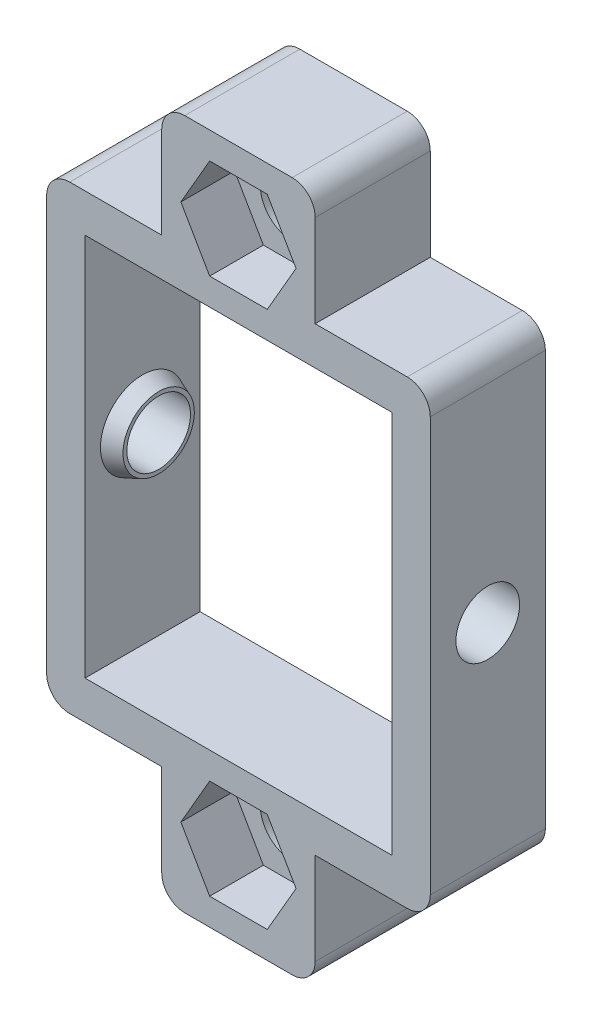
ISO-10303-21;
HEADER;
FILE_DESCRIPTION(('STEP AP214'),'2;1');
FILE_NAME('part.step','',(''),(''),'','','');
FILE_SCHEMA(('AUTOMOTIVE_DESIGN { 1 0 10303 214 1 1 1 1 }'));
ENDSEC;
DATA;
#1=APPLICATION_CONTEXT('core data for automotive mechanical design processes');
#2=APPLICATION_PROTOCOL_DEFINITION('international standard','automotive_design',2000,#1);
#3=PRODUCT_CONTEXT('',#1,'mechanical');
#4=PRODUCT('Part','Part','',(#3));
#5=PRODUCT_RELATED_PRODUCT_CATEGORY('part','',(#4));
#6=PRODUCT_DEFINITION_FORMATION('','',#4);
#7=PRODUCT_DEFINITION_CONTEXT('part definition',#1,'design');
#8=PRODUCT_DEFINITION('design','',#6,#7);
#9=PRODUCT_DEFINITION_SHAPE('','',#8);
#10=(LENGTH_UNIT() NAMED_UNIT(*) SI_UNIT(.MILLI.,.METRE.));
#11=(NAMED_UNIT(*) PLANE_ANGLE_UNIT() SI_UNIT($,.RADIAN.));
#12=(NAMED_UNIT(*) SI_UNIT($,.STERADIAN.) SOLID_ANGLE_UNIT());
#13=UNCERTAINTY_MEASURE_WITH_UNIT(LENGTH_MEASURE(1.E-05),#10,'distance_accuracy_value','');
#14=(GEOMETRIC_REPRESENTATION_CONTEXT(3) GLOBAL_UNCERTAINTY_ASSIGNED_CONTEXT((#13)) GLOBAL_UNIT_ASSIGNED_CONTEXT((#10,
#11,#12)) REPRESENTATION_CONTEXT('',''));
#15=CARTESIAN_POINT('',(0.,0.,0.));
#16=DIRECTION('',(0.,0.,1.));
#17=DIRECTION('',(1.,0.,0.));
#18=AXIS2_PLACEMENT_3D('',#15,#16,#17);
#19=CARTESIAN_POINT('',(40.,0.,15.));
#20=DIRECTION('',(-1.,0.,0.));
#21=DIRECTION('',(0.,-1.,0.));
#22=AXIS2_PLACEMENT_3D('',#19,#20,#21);
#23=PLANE('',#22);
#24=CARTESIAN_POINT('',(40.,-25.,7.5));
#25=DIRECTION('',(-1.,0.,0.));
#26=DIRECTION('',(0.,-1.,0.));
#27=AXIS2_PLACEMENT_3D('',#24,#25,#26);
#28=CIRCLE('',#27,5.48999999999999);
#29=CARTESIAN_POINT('',(40.,-30.49,7.5));
#30=VERTEX_POINT('',#29);
#31=EDGE_CURVE('E11',#30,#30,#28,.F.);
#32=ORIENTED_EDGE('',*,*,#31,.T.);
#33=EDGE_LOOP('',(#32));
#34=FACE_BOUND('',#33,.T.);
#35=DIRECTION('',(0.,1.,0.));
#36=VECTOR('',#35,1.);
#37=CARTESIAN_POINT('',(40.,0.,0.));
#38=LINE('',#37,#36);
#39=CARTESIAN_POINT('',(40.,-50.,0.));
#40=VERTEX_POINT('',#39);
#41=CARTESIAN_POINT('',(40.,0.,0.));
#42=VERTEX_POINT('',#41);
#43=EDGE_CURVE('E408',#40,#42,#38,.T.);
#44=ORIENTED_EDGE('',*,*,#43,.F.);
#45=DIRECTION('',(0.,0.,-1.));
#46=VECTOR('',#45,1.);
#47=CARTESIAN_POINT('',(40.,-50.,15.));
#48=LINE('',#47,#46);
#49=CARTESIAN_POINT('',(40.,-50.,15.));
#50=VERTEX_POINT('',#49);
#51=EDGE_CURVE('E417',#50,#40,#48,.T.);
#52=ORIENTED_EDGE('',*,*,#51,.F.);
#53=DIRECTION('',(0.,1.,0.));
#54=VECTOR('',#53,1.);
#55=CARTESIAN_POINT('',(40.,0.,15.));
#56=LINE('',#55,#54);
#57=CARTESIAN_POINT('',(40.,0.,15.));
#58=VERTEX_POINT('',#57);
#59=EDGE_CURVE('E397',#50,#58,#56,.T.);
#60=ORIENTED_EDGE('',*,*,#59,.T.);
#61=DIRECTION('',(0.,0.,-1.));
#62=VECTOR('',#61,1.);
#63=CARTESIAN_POINT('',(40.,0.,15.));
#64=LINE('',#63,#62);
#65=EDGE_CURVE('E415',#58,#42,#64,.T.);
#66=ORIENTED_EDGE('',*,*,#65,.T.);
#67=EDGE_LOOP('',(#44,#52,#60,#66));
#68=FACE_BOUND('',#67,.T.);
#69=ADVANCED_FACE('F36',(#34,#68),#23,.T.);
#70=CARTESIAN_POINT('',(0.,0.,15.));
#71=DIRECTION('',(1.,0.,0.));
#72=DIRECTION('',(0.,1.,0.));
#73=AXIS2_PLACEMENT_3D('',#70,#71,#72);
#74=PLANE('',#73);
#75=CARTESIAN_POINT('',(0.,-25.,7.5));
#76=DIRECTION('',(1.,0.,0.));
#77=DIRECTION('',(0.,1.,0.));
#78=AXIS2_PLACEMENT_3D('',#75,#76,#77);
#79=CIRCLE('',#78,5.49);
#80=CARTESIAN_POINT('',(0.,-19.51,7.5));
#81=VERTEX_POINT('',#80);
#82=EDGE_CURVE('E45',#81,#81,#79,.F.);
#83=ORIENTED_EDGE('',*,*,#82,.T.);
#84=EDGE_LOOP('',(#83));
#85=FACE_BOUND('',#84,.T.);
#86=DIRECTION('',(0.,-1.,0.));
#87=VECTOR('',#86,1.);
#88=CARTESIAN_POINT('',(0.,0.,0.));
#89=LINE('',#88,#87);
#90=CARTESIAN_POINT('',(0.,0.,0.));
#91=VERTEX_POINT('',#90);
#92=CARTESIAN_POINT('',(0.,-50.,0.));
#93=VERTEX_POINT('',#92);
#94=EDGE_CURVE('E387',#91,#93,#89,.T.);
#95=ORIENTED_EDGE('',*,*,#94,.F.);
#96=DIRECTION('',(0.,0.,-1.));
#97=VECTOR('',#96,1.);
#98=CARTESIAN_POINT('',(0.,0.,15.));
#99=LINE('',#98,#97);
#100=CARTESIAN_POINT('',(0.,0.,15.));
#101=VERTEX_POINT('',#100);
#102=EDGE_CURVE('E402',#101,#91,#99,.T.);
#103=ORIENTED_EDGE('',*,*,#102,.F.);
#104=DIRECTION('',(0.,-1.,0.));
#105=VECTOR('',#104,1.);
#106=CARTESIAN_POINT('',(0.,0.,15.));
#107=LINE('',#106,#105);
#108=CARTESIAN_POINT('',(0.,-50.,15.));
#109=VERTEX_POINT('',#108);
#110=EDGE_CURVE('E392',#101,#109,#107,.T.);
#111=ORIENTED_EDGE('',*,*,#110,.T.);
#112=DIRECTION('',(0.,0.,-1.));
#113=VECTOR('',#112,1.);
#114=CARTESIAN_POINT('',(0.,-50.,15.));
#115=LINE('',#114,#113);
#116=EDGE_CURVE('E419',#109,#93,#115,.T.);
#117=ORIENTED_EDGE('',*,*,#116,.T.);
#118=EDGE_LOOP('',(#95,#103,#111,#117));
#119=FACE_BOUND('',#118,.T.);
#120=ADVANCED_FACE('F578',(#85,#119),#74,.T.);
#121=CARTESIAN_POINT('',(20.,-60.,0.));
#122=DIRECTION('',(0.,0.,1.));
#123=DIRECTION('',(1.,0.,0.));
#124=AXIS2_PLACEMENT_3D('',#121,#122,#123);
#125=CYLINDRICAL_SURFACE('',#124,4.15);
#126=CARTESIAN_POINT('',(20.,-60.,0.));
#127=DIRECTION('',(0.,0.,1.));
#128=DIRECTION('',(1.,0.,0.));
#129=AXIS2_PLACEMENT_3D('',#126,#127,#128);
#130=CIRCLE('',#129,4.15);
#131=CARTESIAN_POINT('',(24.15,-60.,0.));
#132=VERTEX_POINT('',#131);
#133=EDGE_CURVE('E388',#132,#132,#130,.T.);
#134=ORIENTED_EDGE('',*,*,#133,.F.);
#135=EDGE_LOOP('',(#134));
#136=FACE_BOUND('',#135,.T.);
#137=CARTESIAN_POINT('',(20.,-60.,8.));
#138=DIRECTION('',(0.,0.,1.));
#139=DIRECTION('',(1.,0.,0.));
#140=AXIS2_PLACEMENT_3D('',#137,#138,#139);
#141=CIRCLE('',#140,4.15);
#142=CARTESIAN_POINT('',(24.15,-60.,8.));
#143=VERTEX_POINT('',#142);
#144=EDGE_CURVE('E391',#143,#143,#141,.F.);
#145=ORIENTED_EDGE('',*,*,#144,.F.);
#146=EDGE_LOOP('',(#145));
#147=FACE_BOUND('',#146,.T.);
#148=ADVANCED_FACE('F626',(#136,#147),#125,.F.);
#149=CARTESIAN_POINT('',(20.,10.,0.));
#150=DIRECTION('',(0.,0.,1.));
#151=DIRECTION('',(1.,0.,0.));
#152=AXIS2_PLACEMENT_3D('',#149,#150,#151);
#153=CYLINDRICAL_SURFACE('',#152,4.15);
#154=CARTESIAN_POINT('',(20.,10.,0.));
#155=DIRECTION('',(0.,0.,1.));
#156=DIRECTION('',(1.,0.,0.));
#157=AXIS2_PLACEMENT_3D('',#154,#155,#156);
#158=CIRCLE('',#157,4.15);
#159=CARTESIAN_POINT('',(24.15,10.,0.));
#160=VERTEX_POINT('',#159);
#161=EDGE_CURVE('E384',#160,#160,#158,.T.);
#162=ORIENTED_EDGE('',*,*,#161,.F.);
#163=EDGE_LOOP('',(#162));
#164=FACE_BOUND('',#163,.T.);
#165=CARTESIAN_POINT('',(20.,10.,8.));
#166=DIRECTION('',(0.,0.,1.));
#167=DIRECTION('',(1.,0.,0.));
#168=AXIS2_PLACEMENT_3D('',#165,#166,#167);
#169=CIRCLE('',#168,4.15);
#170=CARTESIAN_POINT('',(24.15,10.,8.));
#171=VERTEX_POINT('',#170);
#172=EDGE_CURVE('E328',#171,#171,#169,.F.);
#173=ORIENTED_EDGE('',*,*,#172,.F.);
#174=EDGE_LOOP('',(#173));
#175=FACE_BOUND('',#174,.T.);
#176=ADVANCED_FACE('F642',(#164,#175),#153,.F.);
#177=CARTESIAN_POINT('',(0.,0.,15.));
#178=DIRECTION('',(0.,0.,1.));
#179=DIRECTION('',(1.,0.,0.));
#180=AXIS2_PLACEMENT_3D('',#177,#178,#179);
#181=PLANE('',#180);
#182=DIRECTION('',(-1.,0.,0.));
#183=VECTOR('',#182,1.);
#184=CARTESIAN_POINT('',(23.7527767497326,16.5,15.));
#185=LINE('',#184,#183);
#186=CARTESIAN_POINT('',(23.7527767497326,16.5,15.));
#187=VERTEX_POINT('',#186);
#188=CARTESIAN_POINT('',(16.2472232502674,16.5,15.));
#189=VERTEX_POINT('',#188);
#190=EDGE_CURVE('E279',#187,#189,#185,.T.);
#191=ORIENTED_EDGE('',*,*,#190,.F.);
#192=DIRECTION('',(-0.5,0.866025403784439,0.));
#193=VECTOR('',#192,1.);
#194=CARTESIAN_POINT('',(27.5055534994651,10.,15.));
#195=LINE('',#194,#193);
#196=CARTESIAN_POINT('',(27.5055534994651,10.,15.));
#197=VERTEX_POINT('',#196);
#198=EDGE_CURVE('E298',#197,#187,#195,.T.);
#199=ORIENTED_EDGE('',*,*,#198,.F.);
#200=DIRECTION('',(0.5,0.866025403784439,0.));
#201=VECTOR('',#200,1.);
#202=CARTESIAN_POINT('',(23.7527767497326,3.50000000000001,15.));
#203=LINE('',#202,#201);
#204=CARTESIAN_POINT('',(23.7527767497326,3.50000000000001,15.));
#205=VERTEX_POINT('',#204);
#206=EDGE_CURVE('E301',#205,#197,#203,.T.);
#207=ORIENTED_EDGE('',*,*,#206,.F.);
#208=DIRECTION('',(1.,0.,0.));
#209=VECTOR('',#208,1.);
#210=CARTESIAN_POINT('',(16.2472232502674,3.50000000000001,15.));
#211=LINE('',#210,#209);
#212=CARTESIAN_POINT('',(16.2472232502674,3.50000000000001,15.));
#213=VERTEX_POINT('',#212);
#214=EDGE_CURVE('E321',#213,#205,#211,.T.);
#215=ORIENTED_EDGE('',*,*,#214,.F.);
#216=DIRECTION('',(0.5,-0.866025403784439,0.));
#217=VECTOR('',#216,1.);
#218=CARTESIAN_POINT('',(12.4944465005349,10.,15.));
#219=LINE('',#218,#217);
#220=CARTESIAN_POINT('',(12.4944465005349,10.,15.));
#221=VERTEX_POINT('',#220);
#222=EDGE_CURVE('E318',#221,#213,#219,.T.);
#223=ORIENTED_EDGE('',*,*,#222,.F.);
#224=DIRECTION('',(-0.5,-0.866025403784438,0.));
#225=VECTOR('',#224,1.);
#226=CARTESIAN_POINT('',(16.2472232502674,16.5,15.));
#227=LINE('',#226,#225);
#228=EDGE_CURVE('E315',#189,#221,#227,.T.);
#229=ORIENTED_EDGE('',*,*,#228,.F.);
#230=EDGE_LOOP('',(#191,#199,#207,#215,#223,#229));
#231=FACE_BOUND('',#230,.T.);
#232=DIRECTION('',(-0.5,-0.866025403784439,0.));
#233=VECTOR('',#232,1.);
#234=CARTESIAN_POINT('',(16.2472232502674,-53.5,15.));
#235=LINE('',#234,#233);
#236=CARTESIAN_POINT('',(16.2472232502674,-53.5,15.));
#237=VERTEX_POINT('',#236);
#238=CARTESIAN_POINT('',(12.4944465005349,-60.,15.));
#239=VERTEX_POINT('',#238);
#240=EDGE_CURVE('E356',#237,#239,#235,.T.);
#241=ORIENTED_EDGE('',*,*,#240,.F.);
#242=DIRECTION('',(-1.,0.,0.));
#243=VECTOR('',#242,1.);
#244=CARTESIAN_POINT('',(23.7527767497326,-53.5,15.));
#245=LINE('',#244,#243);
#246=CARTESIAN_POINT('',(23.7527767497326,-53.5,15.));
#247=VERTEX_POINT('',#246);
#248=EDGE_CURVE('E340',#247,#237,#245,.T.);
#249=ORIENTED_EDGE('',*,*,#248,.F.);
#250=DIRECTION('',(-0.5,0.866025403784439,0.));
#251=VECTOR('',#250,1.);
#252=CARTESIAN_POINT('',(27.5055534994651,-60.,15.));
#253=LINE('',#252,#251);
#254=CARTESIAN_POINT('',(27.5055534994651,-60.,15.));
#255=VERTEX_POINT('',#254);
#256=EDGE_CURVE('E368',#255,#247,#253,.T.);
#257=ORIENTED_EDGE('',*,*,#256,.F.);
#258=DIRECTION('',(0.5,0.866025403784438,0.));
#259=VECTOR('',#258,1.);
#260=CARTESIAN_POINT('',(23.7527767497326,-66.5,15.));
#261=LINE('',#260,#259);
#262=CARTESIAN_POINT('',(23.7527767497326,-66.5,15.));
#263=VERTEX_POINT('',#262);
#264=EDGE_CURVE('E365',#263,#255,#261,.T.);
#265=ORIENTED_EDGE('',*,*,#264,.F.);
#266=DIRECTION('',(1.,0.,0.));
#267=VECTOR('',#266,1.);
#268=CARTESIAN_POINT('',(16.2472232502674,-66.5,15.));
#269=LINE('',#268,#267);
#270=CARTESIAN_POINT('',(16.2472232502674,-66.5,15.));
#271=VERTEX_POINT('',#270);
#272=EDGE_CURVE('E362',#271,#263,#269,.T.);
#273=ORIENTED_EDGE('',*,*,#272,.F.);
#274=DIRECTION('',(0.5,-0.866025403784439,0.));
#275=VECTOR('',#274,1.);
#276=CARTESIAN_POINT('',(12.4944465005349,-60.,15.));
#277=LINE('',#276,#275);
#278=EDGE_CURVE('E358',#239,#271,#277,.T.);
#279=ORIENTED_EDGE('',*,*,#278,.F.);
#280=EDGE_LOOP('',(#241,#249,#257,#265,#273,#279));
#281=FACE_BOUND('',#280,.T.);
#282=DIRECTION('',(1.,0.,0.));
#283=VECTOR('',#282,1.);
#284=CARTESIAN_POINT('',(10.,-70.,15.));
#285=LINE('',#284,#283);
#286=CARTESIAN_POINT('',(13.,-70.,15.));
#287=VERTEX_POINT('',#286);
#288=CARTESIAN_POINT('',(27.,-70.,15.));
#289=VERTEX_POINT('',#288);
#290=EDGE_CURVE('E435',#287,#289,#285,.T.);
#291=ORIENTED_EDGE('',*,*,#290,.T.);
#292=CARTESIAN_POINT('',(27.,-67.,15.));
#293=DIRECTION('',(0.,0.,1.));
#294=DIRECTION('',(1.,0.,0.));
#295=AXIS2_PLACEMENT_3D('',#292,#293,#294);
#296=CIRCLE('',#295,3.);
#297=CARTESIAN_POINT('',(30.,-67.,15.));
#298=VERTEX_POINT('',#297);
#299=EDGE_CURVE('E537',#289,#298,#296,.T.);
#300=ORIENTED_EDGE('',*,*,#299,.T.);
#301=DIRECTION('',(0.,1.,0.));
#302=VECTOR('',#301,1.);
#303=CARTESIAN_POINT('',(30.,-55.,15.));
#304=LINE('',#303,#302);
#305=CARTESIAN_POINT('',(30.,-55.,15.));
#306=VERTEX_POINT('',#305);
#307=EDGE_CURVE('E438',#298,#306,#304,.T.);
#308=ORIENTED_EDGE('',*,*,#307,.T.);
#309=DIRECTION('',(1.,0.,0.));
#310=VECTOR('',#309,1.);
#311=CARTESIAN_POINT('',(30.,-55.,15.));
#312=LINE('',#311,#310);
#313=CARTESIAN_POINT('',(42.,-55.,15.));
#314=VERTEX_POINT('',#313);
#315=EDGE_CURVE('E440',#306,#314,#312,.T.);
#316=ORIENTED_EDGE('',*,*,#315,.T.);
#317=CARTESIAN_POINT('',(42.,-52.,15.));
#318=DIRECTION('',(0.,0.,1.));
#319=DIRECTION('',(1.,0.,0.));
#320=AXIS2_PLACEMENT_3D('',#317,#318,#319);
#321=CIRCLE('',#320,3.);
#322=CARTESIAN_POINT('',(45.,-52.,15.));
#323=VERTEX_POINT('',#322);
#324=EDGE_CURVE('E535',#314,#323,#321,.T.);
#325=ORIENTED_EDGE('',*,*,#324,.T.);
#326=DIRECTION('',(0.,1.,0.));
#327=VECTOR('',#326,1.);
#328=CARTESIAN_POINT('',(45.,5.,15.));
#329=LINE('',#328,#327);
#330=CARTESIAN_POINT('',(45.,2.,15.));
#331=VERTEX_POINT('',#330);
#332=EDGE_CURVE('E443',#323,#331,#329,.T.);
#333=ORIENTED_EDGE('',*,*,#332,.T.);
#334=CARTESIAN_POINT('',(42.,2.,15.));
#335=DIRECTION('',(0.,0.,1.));
#336=DIRECTION('',(1.,0.,0.));
#337=AXIS2_PLACEMENT_3D('',#334,#335,#336);
#338=CIRCLE('',#337,3.);
#339=CARTESIAN_POINT('',(42.,5.,15.));
#340=VERTEX_POINT('',#339);
#341=EDGE_CURVE('E533',#331,#340,#338,.T.);
#342=ORIENTED_EDGE('',*,*,#341,.T.);
#343=DIRECTION('',(-1.,0.,0.));
#344=VECTOR('',#343,1.);
#345=CARTESIAN_POINT('',(30.,5.,15.));
#346=LINE('',#345,#344);
#347=CARTESIAN_POINT('',(30.,5.,15.));
#348=VERTEX_POINT('',#347);
#349=EDGE_CURVE('E446',#340,#348,#346,.T.);
#350=ORIENTED_EDGE('',*,*,#349,.T.);
#351=DIRECTION('',(0.,1.,0.));
#352=VECTOR('',#351,1.);
#353=CARTESIAN_POINT('',(30.,5.,15.));
#354=LINE('',#353,#352);
#355=CARTESIAN_POINT('',(30.,17.,15.));
#356=VERTEX_POINT('',#355);
#357=EDGE_CURVE('E448',#348,#356,#354,.T.);
#358=ORIENTED_EDGE('',*,*,#357,.T.);
#359=CARTESIAN_POINT('',(27.,17.,15.));
#360=DIRECTION('',(0.,0.,1.));
#361=DIRECTION('',(1.,0.,0.));
#362=AXIS2_PLACEMENT_3D('',#359,#360,#361);
#363=CIRCLE('',#362,3.);
#364=CARTESIAN_POINT('',(27.,20.,15.));
#365=VERTEX_POINT('',#364);
#366=EDGE_CURVE('E531',#356,#365,#363,.T.);
#367=ORIENTED_EDGE('',*,*,#366,.T.);
#368=DIRECTION('',(-1.,0.,0.));
#369=VECTOR('',#368,1.);
#370=CARTESIAN_POINT('',(10.,20.,15.));
#371=LINE('',#370,#369);
#372=CARTESIAN_POINT('',(13.,20.,15.));
#373=VERTEX_POINT('',#372);
#374=EDGE_CURVE('E451',#365,#373,#371,.T.);
#375=ORIENTED_EDGE('',*,*,#374,.T.);
#376=CARTESIAN_POINT('',(13.,17.,15.));
#377=DIRECTION('',(0.,0.,1.));
#378=DIRECTION('',(1.,0.,0.));
#379=AXIS2_PLACEMENT_3D('',#376,#377,#378);
#380=CIRCLE('',#379,3.);
#381=CARTESIAN_POINT('',(10.,17.,15.));
#382=VERTEX_POINT('',#381);
#383=EDGE_CURVE('E52',#373,#382,#380,.T.);
#384=ORIENTED_EDGE('',*,*,#383,.T.);
#385=DIRECTION('',(0.,-1.,0.));
#386=VECTOR('',#385,1.);
#387=CARTESIAN_POINT('',(10.,5.,15.));
#388=LINE('',#387,#386);
#389=CARTESIAN_POINT('',(10.,5.,15.));
#390=VERTEX_POINT('',#389);
#391=EDGE_CURVE('E453',#382,#390,#388,.T.);
#392=ORIENTED_EDGE('',*,*,#391,.T.);
#393=DIRECTION('',(-1.,0.,0.));
#394=VECTOR('',#393,1.);
#395=CARTESIAN_POINT('',(-5.,5.,15.));
#396=LINE('',#395,#394);
#397=CARTESIAN_POINT('',(-2.,5.,15.));
#398=VERTEX_POINT('',#397);
#399=EDGE_CURVE('E423',#390,#398,#396,.T.);
#400=ORIENTED_EDGE('',*,*,#399,.T.);
#401=CARTESIAN_POINT('',(-2.,2.,15.));
#402=DIRECTION('',(0.,0.,1.));
#403=DIRECTION('',(1.,0.,0.));
#404=AXIS2_PLACEMENT_3D('',#401,#402,#403);
#405=CIRCLE('',#404,3.);
#406=CARTESIAN_POINT('',(-5.,2.,15.));
#407=VERTEX_POINT('',#406);
#408=EDGE_CURVE('E528',#398,#407,#405,.T.);
#409=ORIENTED_EDGE('',*,*,#408,.T.);
#410=DIRECTION('',(0.,-1.,0.));
#411=VECTOR('',#410,1.);
#412=CARTESIAN_POINT('',(-5.,5.,15.));
#413=LINE('',#412,#411);
#414=CARTESIAN_POINT('',(-5.,-52.,15.));
#415=VERTEX_POINT('',#414);
#416=EDGE_CURVE('E426',#407,#415,#413,.T.);
#417=ORIENTED_EDGE('',*,*,#416,.T.);
#418=CARTESIAN_POINT('',(-2.,-52.,15.));
#419=DIRECTION('',(0.,0.,1.));
#420=DIRECTION('',(1.,0.,0.));
#421=AXIS2_PLACEMENT_3D('',#418,#419,#420);
#422=CIRCLE('',#421,3.);
#423=CARTESIAN_POINT('',(-2.,-55.,15.));
#424=VERTEX_POINT('',#423);
#425=EDGE_CURVE('E526',#415,#424,#422,.T.);
#426=ORIENTED_EDGE('',*,*,#425,.T.);
#427=DIRECTION('',(1.,0.,0.));
#428=VECTOR('',#427,1.);
#429=CARTESIAN_POINT('',(-5.,-55.,15.));
#430=LINE('',#429,#428);
#431=CARTESIAN_POINT('',(10.,-55.,15.));
#432=VERTEX_POINT('',#431);
#433=EDGE_CURVE('E430',#424,#432,#430,.T.);
#434=ORIENTED_EDGE('',*,*,#433,.T.);
#435=DIRECTION('',(0.,-1.,0.));
#436=VECTOR('',#435,1.);
#437=CARTESIAN_POINT('',(10.,-55.,15.));
#438=LINE('',#437,#436);
#439=CARTESIAN_POINT('',(10.,-67.,15.));
#440=VERTEX_POINT('',#439);
#441=EDGE_CURVE('E432',#432,#440,#438,.T.);
#442=ORIENTED_EDGE('',*,*,#441,.T.);
#443=CARTESIAN_POINT('',(13.,-67.,15.));
#444=DIRECTION('',(0.,0.,1.));
#445=DIRECTION('',(1.,0.,0.));
#446=AXIS2_PLACEMENT_3D('',#443,#444,#445);
#447=CIRCLE('',#446,3.);
#448=EDGE_CURVE('E524',#440,#287,#447,.T.);
#449=ORIENTED_EDGE('',*,*,#448,.T.);
#450=EDGE_LOOP('',(#291,#300,#308,#316,#325,#333,#342,#350,#358,#367,#375,#384,#392,#400,#409,
#417,#426,#434,#442,#449));
#451=FACE_BOUND('',#450,.T.);
#452=DIRECTION('',(1.,0.,0.));
#453=VECTOR('',#452,1.);
#454=CARTESIAN_POINT('',(0.,-50.,15.));
#455=LINE('',#454,#453);
#456=EDGE_CURVE('E394',#109,#50,#455,.T.);
#457=ORIENTED_EDGE('',*,*,#456,.F.);
#458=ORIENTED_EDGE('',*,*,#110,.F.);
#459=DIRECTION('',(-1.,0.,0.));
#460=VECTOR('',#459,1.);
#461=CARTESIAN_POINT('',(0.,0.,15.));
#462=LINE('',#461,#460);
#463=EDGE_CURVE('E400',#58,#101,#462,.T.);
#464=ORIENTED_EDGE('',*,*,#463,.F.);
#465=ORIENTED_EDGE('',*,*,#59,.F.);
#466=EDGE_LOOP('',(#457,#458,#464,#465));
#467=FACE_BOUND('',#466,.T.);
#468=ADVANCED_FACE('F638',(#231,#281,#451,#467),#181,.T.);
#469=CARTESIAN_POINT('',(0.,0.,0.));
#470=DIRECTION('',(0.,0.,1.));
#471=DIRECTION('',(1.,0.,0.));
#472=AXIS2_PLACEMENT_3D('',#469,#470,#471);
#473=PLANE('',#472);
#474=ORIENTED_EDGE('',*,*,#161,.T.);
#475=EDGE_LOOP('',(#474));
#476=FACE_BOUND('',#475,.T.);
#477=ORIENTED_EDGE('',*,*,#133,.T.);
#478=EDGE_LOOP('',(#477));
#479=FACE_BOUND('',#478,.T.);
#480=DIRECTION('',(0.,1.,0.));
#481=VECTOR('',#480,1.);
#482=CARTESIAN_POINT('',(30.,-55.,0.));
#483=LINE('',#482,#481);
#484=CARTESIAN_POINT('',(30.,-67.,0.));
#485=VERTEX_POINT('',#484);
#486=CARTESIAN_POINT('',(30.,-55.,0.));
#487=VERTEX_POINT('',#486);
#488=EDGE_CURVE('E469',#485,#487,#483,.T.);
#489=ORIENTED_EDGE('',*,*,#488,.F.);
#490=CARTESIAN_POINT('',(27.,-67.,0.));
#491=DIRECTION('',(0.,0.,1.));
#492=DIRECTION('',(1.,0.,0.));
#493=AXIS2_PLACEMENT_3D('',#490,#491,#492);
#494=CIRCLE('',#493,3.);
#495=CARTESIAN_POINT('',(27.,-70.,0.));
#496=VERTEX_POINT('',#495);
#497=EDGE_CURVE('E517',#485,#496,#494,.F.);
#498=ORIENTED_EDGE('',*,*,#497,.T.);
#499=DIRECTION('',(1.,0.,0.));
#500=VECTOR('',#499,1.);
#501=CARTESIAN_POINT('',(10.,-70.,0.));
#502=LINE('',#501,#500);
#503=CARTESIAN_POINT('',(13.,-70.,0.));
#504=VERTEX_POINT('',#503);
#505=EDGE_CURVE('E466',#504,#496,#502,.T.);
#506=ORIENTED_EDGE('',*,*,#505,.F.);
#507=CARTESIAN_POINT('',(13.,-67.,0.));
#508=DIRECTION('',(0.,0.,1.));
#509=DIRECTION('',(1.,0.,0.));
#510=AXIS2_PLACEMENT_3D('',#507,#508,#509);
#511=CIRCLE('',#510,3.);
#512=CARTESIAN_POINT('',(10.,-67.,0.));
#513=VERTEX_POINT('',#512);
#514=EDGE_CURVE('E503',#504,#513,#511,.F.);
#515=ORIENTED_EDGE('',*,*,#514,.T.);
#516=DIRECTION('',(0.,-1.,0.));
#517=VECTOR('',#516,1.);
#518=CARTESIAN_POINT('',(10.,-55.,0.));
#519=LINE('',#518,#517);
#520=CARTESIAN_POINT('',(10.,-55.,0.));
#521=VERTEX_POINT('',#520);
#522=EDGE_CURVE('E463',#521,#513,#519,.T.);
#523=ORIENTED_EDGE('',*,*,#522,.F.);
#524=DIRECTION('',(1.,0.,0.));
#525=VECTOR('',#524,1.);
#526=CARTESIAN_POINT('',(-5.,-55.,0.));
#527=LINE('',#526,#525);
#528=CARTESIAN_POINT('',(-2.,-55.,0.));
#529=VERTEX_POINT('',#528);
#530=EDGE_CURVE('E461',#529,#521,#527,.T.);
#531=ORIENTED_EDGE('',*,*,#530,.F.);
#532=CARTESIAN_POINT('',(-2.,-52.,0.));
#533=DIRECTION('',(0.,0.,1.));
#534=DIRECTION('',(1.,0.,0.));
#535=AXIS2_PLACEMENT_3D('',#532,#533,#534);
#536=CIRCLE('',#535,3.);
#537=CARTESIAN_POINT('',(-5.,-52.,0.));
#538=VERTEX_POINT('',#537);
#539=EDGE_CURVE('E505',#529,#538,#536,.F.);
#540=ORIENTED_EDGE('',*,*,#539,.T.);
#541=DIRECTION('',(0.,-1.,0.));
#542=VECTOR('',#541,1.);
#543=CARTESIAN_POINT('',(-5.,5.,0.));
#544=LINE('',#543,#542);
#545=CARTESIAN_POINT('',(-5.,2.,0.));
#546=VERTEX_POINT('',#545);
#547=EDGE_CURVE('E458',#546,#538,#544,.T.);
#548=ORIENTED_EDGE('',*,*,#547,.F.);
#549=CARTESIAN_POINT('',(-2.,2.,0.));
#550=DIRECTION('',(0.,0.,1.));
#551=DIRECTION('',(1.,0.,0.));
#552=AXIS2_PLACEMENT_3D('',#549,#550,#551);
#553=CIRCLE('',#552,3.);
#554=CARTESIAN_POINT('',(-2.,5.,0.));
#555=VERTEX_POINT('',#554);
#556=EDGE_CURVE('E507',#546,#555,#553,.F.);
#557=ORIENTED_EDGE('',*,*,#556,.T.);
#558=DIRECTION('',(-1.,0.,0.));
#559=VECTOR('',#558,1.);
#560=CARTESIAN_POINT('',(-5.,5.,0.));
#561=LINE('',#560,#559);
#562=CARTESIAN_POINT('',(10.,5.,0.));
#563=VERTEX_POINT('',#562);
#564=EDGE_CURVE('E422',#563,#555,#561,.T.);
#565=ORIENTED_EDGE('',*,*,#564,.F.);
#566=DIRECTION('',(0.,-1.,0.));
#567=VECTOR('',#566,1.);
#568=CARTESIAN_POINT('',(10.,5.,0.));
#569=LINE('',#568,#567);
#570=CARTESIAN_POINT('',(10.,17.,0.));
#571=VERTEX_POINT('',#570);
#572=EDGE_CURVE('E427',#571,#563,#569,.T.);
#573=ORIENTED_EDGE('',*,*,#572,.F.);
#574=CARTESIAN_POINT('',(13.,17.,0.));
#575=DIRECTION('',(0.,0.,1.));
#576=DIRECTION('',(1.,0.,0.));
#577=AXIS2_PLACEMENT_3D('',#574,#575,#576);
#578=CIRCLE('',#577,3.);
#579=CARTESIAN_POINT('',(13.,20.,0.));
#580=VERTEX_POINT('',#579);
#581=EDGE_CURVE('E509',#571,#580,#578,.F.);
#582=ORIENTED_EDGE('',*,*,#581,.T.);
#583=DIRECTION('',(-1.,0.,0.));
#584=VECTOR('',#583,1.);
#585=CARTESIAN_POINT('',(10.,20.,0.));
#586=LINE('',#585,#584);
#587=CARTESIAN_POINT('',(27.,20.,0.));
#588=VERTEX_POINT('',#587);
#589=EDGE_CURVE('E482',#588,#580,#586,.T.);
#590=ORIENTED_EDGE('',*,*,#589,.F.);
#591=CARTESIAN_POINT('',(27.,17.,0.));
#592=DIRECTION('',(0.,0.,1.));
#593=DIRECTION('',(1.,0.,0.));
#594=AXIS2_PLACEMENT_3D('',#591,#592,#593);
#595=CIRCLE('',#594,3.);
#596=CARTESIAN_POINT('',(30.,17.,0.));
#597=VERTEX_POINT('',#596);
#598=EDGE_CURVE('E511',#588,#597,#595,.F.);
#599=ORIENTED_EDGE('',*,*,#598,.T.);
#600=DIRECTION('',(0.,1.,0.));
#601=VECTOR('',#600,1.);
#602=CARTESIAN_POINT('',(30.,5.,0.));
#603=LINE('',#602,#601);
#604=CARTESIAN_POINT('',(30.,5.,0.));
#605=VERTEX_POINT('',#604);
#606=EDGE_CURVE('E479',#605,#597,#603,.T.);
#607=ORIENTED_EDGE('',*,*,#606,.F.);
#608=DIRECTION('',(-1.,0.,0.));
#609=VECTOR('',#608,1.);
#610=CARTESIAN_POINT('',(30.,5.,0.));
#611=LINE('',#610,#609);
#612=CARTESIAN_POINT('',(42.,5.,0.));
#613=VERTEX_POINT('',#612);
#614=EDGE_CURVE('E477',#613,#605,#611,.T.);
#615=ORIENTED_EDGE('',*,*,#614,.F.);
#616=CARTESIAN_POINT('',(42.,2.,0.));
#617=DIRECTION('',(0.,0.,1.));
#618=DIRECTION('',(1.,0.,0.));
#619=AXIS2_PLACEMENT_3D('',#616,#617,#618);
#620=CIRCLE('',#619,3.);
#621=CARTESIAN_POINT('',(45.,2.,0.));
#622=VERTEX_POINT('',#621);
#623=EDGE_CURVE('E513',#613,#622,#620,.F.);
#624=ORIENTED_EDGE('',*,*,#623,.T.);
#625=DIRECTION('',(0.,1.,0.));
#626=VECTOR('',#625,1.);
#627=CARTESIAN_POINT('',(45.,5.,0.));
#628=LINE('',#627,#626);
#629=CARTESIAN_POINT('',(45.,-52.,0.));
#630=VERTEX_POINT('',#629);
#631=EDGE_CURVE('E474',#630,#622,#628,.T.);
#632=ORIENTED_EDGE('',*,*,#631,.F.);
#633=CARTESIAN_POINT('',(42.,-52.,0.));
#634=DIRECTION('',(0.,0.,1.));
#635=DIRECTION('',(1.,0.,0.));
#636=AXIS2_PLACEMENT_3D('',#633,#634,#635);
#637=CIRCLE('',#636,3.);
#638=CARTESIAN_POINT('',(42.,-55.,0.));
#639=VERTEX_POINT('',#638);
#640=EDGE_CURVE('E515',#630,#639,#637,.F.);
#641=ORIENTED_EDGE('',*,*,#640,.T.);
#642=DIRECTION('',(1.,0.,0.));
#643=VECTOR('',#642,1.);
#644=CARTESIAN_POINT('',(30.,-55.,0.));
#645=LINE('',#644,#643);
#646=EDGE_CURVE('E471',#487,#639,#645,.T.);
#647=ORIENTED_EDGE('',*,*,#646,.F.);
#648=EDGE_LOOP('',(#489,#498,#506,#515,#523,#531,#540,#548,#557,#565,#573,#582,#590,#599,#607,
#615,#624,#632,#641,#647));
#649=FACE_BOUND('',#648,.T.);
#650=ORIENTED_EDGE('',*,*,#94,.T.);
#651=DIRECTION('',(1.,0.,0.));
#652=VECTOR('',#651,1.);
#653=CARTESIAN_POINT('',(0.,-50.,0.));
#654=LINE('',#653,#652);
#655=EDGE_CURVE('E405',#93,#40,#654,.T.);
#656=ORIENTED_EDGE('',*,*,#655,.T.);
#657=ORIENTED_EDGE('',*,*,#43,.T.);
#658=DIRECTION('',(-1.,0.,0.));
#659=VECTOR('',#658,1.);
#660=CARTESIAN_POINT('',(0.,0.,0.));
#661=LINE('',#660,#659);
#662=EDGE_CURVE('E395',#42,#91,#661,.T.);
#663=ORIENTED_EDGE('',*,*,#662,.T.);
#664=EDGE_LOOP('',(#650,#656,#657,#663));
#665=FACE_BOUND('',#664,.T.);
#666=ADVANCED_FACE('F641',(#476,#479,#649,#665),#473,.F.);
#667=CARTESIAN_POINT('',(-5.,5.,15.));
#668=DIRECTION('',(0.,-1.,0.));
#669=DIRECTION('',(0.,0.,-1.));
#670=AXIS2_PLACEMENT_3D('',#667,#668,#669);
#671=PLANE('',#670);
#672=ORIENTED_EDGE('',*,*,#564,.T.);
#673=DIRECTION('',(0.,0.,-1.));
#674=VECTOR('',#673,1.);
#675=CARTESIAN_POINT('',(-2.,5.,15.));
#676=LINE('',#675,#674);
#677=EDGE_CURVE('E563',#555,#398,#676,.F.);
#678=ORIENTED_EDGE('',*,*,#677,.T.);
#679=ORIENTED_EDGE('',*,*,#399,.F.);
#680=DIRECTION('',(0.,0.,-1.));
#681=VECTOR('',#680,1.);
#682=CARTESIAN_POINT('',(10.,5.,15.));
#683=LINE('',#682,#681);
#684=EDGE_CURVE('E455',#390,#563,#683,.T.);
#685=ORIENTED_EDGE('',*,*,#684,.T.);
#686=EDGE_LOOP('',(#672,#678,#679,#685));
#687=FACE_BOUND('',#686,.T.);
#688=ADVANCED_FACE('F646',(#687),#671,.F.);
#689=CARTESIAN_POINT('',(-5.,5.,15.));
#690=DIRECTION('',(1.,0.,0.));
#691=DIRECTION('',(0.,0.,-1.));
#692=AXIS2_PLACEMENT_3D('',#689,#690,#691);
#693=PLANE('',#692);
#694=CARTESIAN_POINT('',(-5.,-25.,7.5));
#695=DIRECTION('',(-1.,0.,0.));
#696=DIRECTION('',(0.,0.,1.));
#697=AXIS2_PLACEMENT_3D('',#694,#695,#696);
#698=CIRCLE('',#697,4.15);
#699=CARTESIAN_POINT('',(-5.,-25.,11.65));
#700=VERTEX_POINT('',#699);
#701=EDGE_CURVE('E304',#700,#700,#698,.T.);
#702=ORIENTED_EDGE('',*,*,#701,.F.);
#703=EDGE_LOOP('',(#702));
#704=FACE_BOUND('',#703,.T.);
#705=ORIENTED_EDGE('',*,*,#416,.F.);
#706=DIRECTION('',(0.,0.,-1.));
#707=VECTOR('',#706,1.);
#708=CARTESIAN_POINT('',(-5.,2.,15.));
#709=LINE('',#708,#707);
#710=EDGE_CURVE('E560',#407,#546,#709,.T.);
#711=ORIENTED_EDGE('',*,*,#710,.T.);
#712=ORIENTED_EDGE('',*,*,#547,.T.);
#713=DIRECTION('',(0.,0.,-1.));
#714=VECTOR('',#713,1.);
#715=CARTESIAN_POINT('',(-5.,-52.,15.));
#716=LINE('',#715,#714);
#717=EDGE_CURVE('E558',#538,#415,#716,.F.);
#718=ORIENTED_EDGE('',*,*,#717,.T.);
#719=EDGE_LOOP('',(#705,#711,#712,#718));
#720=FACE_BOUND('',#719,.T.);
#721=ADVANCED_FACE('F683',(#704,#720),#693,.F.);
#722=CARTESIAN_POINT('',(-5.,-55.,15.));
#723=DIRECTION('',(0.,1.,0.));
#724=DIRECTION('',(0.,0.,1.));
#725=AXIS2_PLACEMENT_3D('',#722,#723,#724);
#726=PLANE('',#725);
#727=ORIENTED_EDGE('',*,*,#433,.F.);
#728=DIRECTION('',(0.,0.,-1.));
#729=VECTOR('',#728,1.);
#730=CARTESIAN_POINT('',(-2.,-55.,15.));
#731=LINE('',#730,#729);
#732=EDGE_CURVE('E565',#424,#529,#731,.T.);
#733=ORIENTED_EDGE('',*,*,#732,.T.);
#734=ORIENTED_EDGE('',*,*,#530,.T.);
#735=DIRECTION('',(0.,0.,-1.));
#736=VECTOR('',#735,1.);
#737=CARTESIAN_POINT('',(10.,-55.,15.));
#738=LINE('',#737,#736);
#739=EDGE_CURVE('E493',#432,#521,#738,.T.);
#740=ORIENTED_EDGE('',*,*,#739,.F.);
#741=EDGE_LOOP('',(#727,#733,#734,#740));
#742=FACE_BOUND('',#741,.T.);
#743=ADVANCED_FACE('F679',(#742),#726,.F.);
#744=CARTESIAN_POINT('',(10.,-55.,15.));
#745=DIRECTION('',(1.,0.,0.));
#746=DIRECTION('',(0.,1.,0.));
#747=AXIS2_PLACEMENT_3D('',#744,#745,#746);
#748=PLANE('',#747);
#749=ORIENTED_EDGE('',*,*,#522,.T.);
#750=DIRECTION('',(0.,0.,-1.));
#751=VECTOR('',#750,1.);
#752=CARTESIAN_POINT('',(10.,-67.,15.));
#753=LINE('',#752,#751);
#754=EDGE_CURVE('E568',#513,#440,#753,.F.);
#755=ORIENTED_EDGE('',*,*,#754,.T.);
#756=ORIENTED_EDGE('',*,*,#441,.F.);
#757=ORIENTED_EDGE('',*,*,#739,.T.);
#758=EDGE_LOOP('',(#749,#755,#756,#757));
#759=FACE_BOUND('',#758,.T.);
#760=ADVANCED_FACE('F675',(#759),#748,.F.);
#761=CARTESIAN_POINT('',(10.,-70.,15.));
#762=DIRECTION('',(0.,1.,0.));
#763=DIRECTION('',(0.,0.,1.));
#764=AXIS2_PLACEMENT_3D('',#761,#762,#763);
#765=PLANE('',#764);
#766=ORIENTED_EDGE('',*,*,#505,.T.);
#767=DIRECTION('',(0.,0.,-1.));
#768=VECTOR('',#767,1.);
#769=CARTESIAN_POINT('',(27.,-70.,15.));
#770=LINE('',#769,#768);
#771=EDGE_CURVE('E522',#496,#289,#770,.F.);
#772=ORIENTED_EDGE('',*,*,#771,.T.);
#773=ORIENTED_EDGE('',*,*,#290,.F.);
#774=DIRECTION('',(0.,0.,-1.));
#775=VECTOR('',#774,1.);
#776=CARTESIAN_POINT('',(13.,-70.,15.));
#777=LINE('',#776,#775);
#778=EDGE_CURVE('E519',#287,#504,#777,.T.);
#779=ORIENTED_EDGE('',*,*,#778,.T.);
#780=EDGE_LOOP('',(#766,#772,#773,#779));
#781=FACE_BOUND('',#780,.T.);
#782=ADVANCED_FACE('F671',(#781),#765,.F.);
#783=CARTESIAN_POINT('',(30.,-55.,15.));
#784=DIRECTION('',(-1.,0.,0.));
#785=DIRECTION('',(0.,0.,1.));
#786=AXIS2_PLACEMENT_3D('',#783,#784,#785);
#787=PLANE('',#786);
#788=ORIENTED_EDGE('',*,*,#307,.F.);
#789=DIRECTION('',(0.,0.,-1.));
#790=VECTOR('',#789,1.);
#791=CARTESIAN_POINT('',(30.,-67.,15.));
#792=LINE('',#791,#790);
#793=EDGE_CURVE('E496',#298,#485,#792,.T.);
#794=ORIENTED_EDGE('',*,*,#793,.T.);
#795=ORIENTED_EDGE('',*,*,#488,.T.);
#796=DIRECTION('',(0.,0.,-1.));
#797=VECTOR('',#796,1.);
#798=CARTESIAN_POINT('',(30.,-55.,15.));
#799=LINE('',#798,#797);
#800=EDGE_CURVE('E490',#306,#487,#799,.T.);
#801=ORIENTED_EDGE('',*,*,#800,.F.);
#802=EDGE_LOOP('',(#788,#794,#795,#801));
#803=FACE_BOUND('',#802,.T.);
#804=ADVANCED_FACE('F667',(#803),#787,.F.);
#805=CARTESIAN_POINT('',(30.,-55.,15.));
#806=DIRECTION('',(0.,1.,0.));
#807=DIRECTION('',(0.,0.,1.));
#808=AXIS2_PLACEMENT_3D('',#805,#806,#807);
#809=PLANE('',#808);
#810=ORIENTED_EDGE('',*,*,#646,.T.);
#811=DIRECTION('',(0.,0.,-1.));
#812=VECTOR('',#811,1.);
#813=CARTESIAN_POINT('',(42.,-55.,15.));
#814=LINE('',#813,#812);
#815=EDGE_CURVE('E544',#639,#314,#814,.F.);
#816=ORIENTED_EDGE('',*,*,#815,.T.);
#817=ORIENTED_EDGE('',*,*,#315,.F.);
#818=ORIENTED_EDGE('',*,*,#800,.T.);
#819=EDGE_LOOP('',(#810,#816,#817,#818));
#820=FACE_BOUND('',#819,.T.);
#821=ADVANCED_FACE('F664',(#820),#809,.F.);
#822=CARTESIAN_POINT('',(45.,5.,15.));
#823=DIRECTION('',(-1.,0.,0.));
#824=DIRECTION('',(0.,0.,1.));
#825=AXIS2_PLACEMENT_3D('',#822,#823,#824);
#826=PLANE('',#825);
#827=CARTESIAN_POINT('',(45.,-25.,7.5));
#828=DIRECTION('',(-1.,0.,0.));
#829=DIRECTION('',(0.,0.,1.));
#830=AXIS2_PLACEMENT_3D('',#827,#828,#829);
#831=CIRCLE('',#830,4.15);
#832=CARTESIAN_POINT('',(45.,-25.,11.65));
#833=VERTEX_POINT('',#832);
#834=EDGE_CURVE('E359',#833,#833,#831,.T.);
#835=ORIENTED_EDGE('',*,*,#834,.T.);
#836=EDGE_LOOP('',(#835));
#837=FACE_BOUND('',#836,.T.);
#838=ORIENTED_EDGE('',*,*,#332,.F.);
#839=DIRECTION('',(0.,0.,-1.));
#840=VECTOR('',#839,1.);
#841=CARTESIAN_POINT('',(45.,-52.,15.));
#842=LINE('',#841,#840);
#843=EDGE_CURVE('E541',#323,#630,#842,.T.);
#844=ORIENTED_EDGE('',*,*,#843,.T.);
#845=ORIENTED_EDGE('',*,*,#631,.T.);
#846=DIRECTION('',(0.,0.,-1.));
#847=VECTOR('',#846,1.);
#848=CARTESIAN_POINT('',(45.,2.,15.));
#849=LINE('',#848,#847);
#850=EDGE_CURVE('E539',#622,#331,#849,.F.);
#851=ORIENTED_EDGE('',*,*,#850,.T.);
#852=EDGE_LOOP('',(#838,#844,#845,#851));
#853=FACE_BOUND('',#852,.T.);
#854=ADVANCED_FACE('F604',(#837,#853),#826,.F.);
#855=CARTESIAN_POINT('',(30.,5.,15.));
#856=DIRECTION('',(0.,-1.,0.));
#857=DIRECTION('',(0.,0.,-1.));
#858=AXIS2_PLACEMENT_3D('',#855,#856,#857);
#859=PLANE('',#858);
#860=ORIENTED_EDGE('',*,*,#349,.F.);
#861=DIRECTION('',(0.,0.,-1.));
#862=VECTOR('',#861,1.);
#863=CARTESIAN_POINT('',(42.,5.,15.));
#864=LINE('',#863,#862);
#865=EDGE_CURVE('E546',#340,#613,#864,.T.);
#866=ORIENTED_EDGE('',*,*,#865,.T.);
#867=ORIENTED_EDGE('',*,*,#614,.T.);
#868=DIRECTION('',(0.,0.,-1.));
#869=VECTOR('',#868,1.);
#870=CARTESIAN_POINT('',(30.,5.,15.));
#871=LINE('',#870,#869);
#872=EDGE_CURVE('E487',#348,#605,#871,.T.);
#873=ORIENTED_EDGE('',*,*,#872,.F.);
#874=EDGE_LOOP('',(#860,#866,#867,#873));
#875=FACE_BOUND('',#874,.T.);
#876=ADVANCED_FACE('F657',(#875),#859,.F.);
#877=CARTESIAN_POINT('',(30.,5.,15.));
#878=DIRECTION('',(-1.,0.,0.));
#879=DIRECTION('',(0.,0.,1.));
#880=AXIS2_PLACEMENT_3D('',#877,#878,#879);
#881=PLANE('',#880);
#882=ORIENTED_EDGE('',*,*,#606,.T.);
#883=DIRECTION('',(0.,0.,-1.));
#884=VECTOR('',#883,1.);
#885=CARTESIAN_POINT('',(30.,17.,15.));
#886=LINE('',#885,#884);
#887=EDGE_CURVE('E553',#597,#356,#886,.F.);
#888=ORIENTED_EDGE('',*,*,#887,.T.);
#889=ORIENTED_EDGE('',*,*,#357,.F.);
#890=ORIENTED_EDGE('',*,*,#872,.T.);
#891=EDGE_LOOP('',(#882,#888,#889,#890));
#892=FACE_BOUND('',#891,.T.);
#893=ADVANCED_FACE('F654',(#892),#881,.F.);
#894=CARTESIAN_POINT('',(10.,20.,15.));
#895=DIRECTION('',(0.,-1.,0.));
#896=DIRECTION('',(0.,0.,-1.));
#897=AXIS2_PLACEMENT_3D('',#894,#895,#896);
#898=PLANE('',#897);
#899=ORIENTED_EDGE('',*,*,#374,.F.);
#900=DIRECTION('',(0.,0.,-1.));
#901=VECTOR('',#900,1.);
#902=CARTESIAN_POINT('',(27.,20.,15.));
#903=LINE('',#902,#901);
#904=EDGE_CURVE('E550',#365,#588,#903,.T.);
#905=ORIENTED_EDGE('',*,*,#904,.T.);
#906=ORIENTED_EDGE('',*,*,#589,.T.);
#907=DIRECTION('',(0.,0.,-1.));
#908=VECTOR('',#907,1.);
#909=CARTESIAN_POINT('',(13.,20.,15.));
#910=LINE('',#909,#908);
#911=EDGE_CURVE('E60',#580,#373,#910,.F.);
#912=ORIENTED_EDGE('',*,*,#911,.T.);
#913=EDGE_LOOP('',(#899,#905,#906,#912));
#914=FACE_BOUND('',#913,.T.);
#915=ADVANCED_FACE('F650',(#914),#898,.F.);
#916=CARTESIAN_POINT('',(10.,5.,15.));
#917=DIRECTION('',(1.,0.,0.));
#918=DIRECTION('',(0.,0.,-1.));
#919=AXIS2_PLACEMENT_3D('',#916,#917,#918);
#920=PLANE('',#919);
#921=ORIENTED_EDGE('',*,*,#391,.F.);
#922=DIRECTION('',(0.,0.,-1.));
#923=VECTOR('',#922,1.);
#924=CARTESIAN_POINT('',(10.,17.,15.));
#925=LINE('',#924,#923);
#926=EDGE_CURVE('E555',#382,#571,#925,.T.);
#927=ORIENTED_EDGE('',*,*,#926,.T.);
#928=ORIENTED_EDGE('',*,*,#572,.T.);
#929=ORIENTED_EDGE('',*,*,#684,.F.);
#930=EDGE_LOOP('',(#921,#927,#928,#929));
#931=FACE_BOUND('',#930,.T.);
#932=ADVANCED_FACE('F635',(#931),#920,.F.);
#933=CARTESIAN_POINT('',(0.,-50.,15.));
#934=DIRECTION('',(0.,1.,0.));
#935=DIRECTION('',(0.,0.,1.));
#936=AXIS2_PLACEMENT_3D('',#933,#934,#935);
#937=PLANE('',#936);
#938=ORIENTED_EDGE('',*,*,#655,.F.);
#939=ORIENTED_EDGE('',*,*,#116,.F.);
#940=ORIENTED_EDGE('',*,*,#456,.T.);
#941=ORIENTED_EDGE('',*,*,#51,.T.);
#942=EDGE_LOOP('',(#938,#939,#940,#941));
#943=FACE_BOUND('',#942,.T.);
#944=ADVANCED_FACE('F633',(#943),#937,.T.);
#945=CARTESIAN_POINT('',(0.,0.,15.));
#946=DIRECTION('',(0.,-1.,0.));
#947=DIRECTION('',(0.,0.,-1.));
#948=AXIS2_PLACEMENT_3D('',#945,#946,#947);
#949=PLANE('',#948);
#950=ORIENTED_EDGE('',*,*,#662,.F.);
#951=ORIENTED_EDGE('',*,*,#65,.F.);
#952=ORIENTED_EDGE('',*,*,#463,.T.);
#953=ORIENTED_EDGE('',*,*,#102,.T.);
#954=EDGE_LOOP('',(#950,#951,#952,#953));
#955=FACE_BOUND('',#954,.T.);
#956=ADVANCED_FACE('F631',(#955),#949,.T.);
#957=CARTESIAN_POINT('',(0.,0.,8.));
#958=DIRECTION('',(0.,0.,1.));
#959=DIRECTION('',(1.,0.,0.));
#960=AXIS2_PLACEMENT_3D('',#957,#958,#959);
#961=PLANE('',#960);
#962=DIRECTION('',(-1.,0.,0.));
#963=VECTOR('',#962,1.);
#964=CARTESIAN_POINT('',(23.7527767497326,16.5,8.));
#965=LINE('',#964,#963);
#966=CARTESIAN_POINT('',(23.7527767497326,16.5,8.));
#967=VERTEX_POINT('',#966);
#968=CARTESIAN_POINT('',(16.2472232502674,16.5,8.));
#969=VERTEX_POINT('',#968);
#970=EDGE_CURVE('E276',#967,#969,#965,.T.);
#971=ORIENTED_EDGE('',*,*,#970,.T.);
#972=DIRECTION('',(-0.5,-0.866025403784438,0.));
#973=VECTOR('',#972,1.);
#974=CARTESIAN_POINT('',(16.2472232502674,16.5,8.));
#975=LINE('',#974,#973);
#976=CARTESIAN_POINT('',(12.4944465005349,10.,8.));
#977=VERTEX_POINT('',#976);
#978=EDGE_CURVE('E287',#969,#977,#975,.T.);
#979=ORIENTED_EDGE('',*,*,#978,.T.);
#980=DIRECTION('',(0.5,-0.866025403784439,0.));
#981=VECTOR('',#980,1.);
#982=CARTESIAN_POINT('',(12.4944465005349,10.,8.));
#983=LINE('',#982,#981);
#984=CARTESIAN_POINT('',(16.2472232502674,3.50000000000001,8.));
#985=VERTEX_POINT('',#984);
#986=EDGE_CURVE('E292',#977,#985,#983,.T.);
#987=ORIENTED_EDGE('',*,*,#986,.T.);
#988=DIRECTION('',(1.,0.,0.));
#989=VECTOR('',#988,1.);
#990=CARTESIAN_POINT('',(16.2472232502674,3.50000000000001,8.));
#991=LINE('',#990,#989);
#992=CARTESIAN_POINT('',(23.7527767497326,3.50000000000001,8.));
#993=VERTEX_POINT('',#992);
#994=EDGE_CURVE('E308',#985,#993,#991,.T.);
#995=ORIENTED_EDGE('',*,*,#994,.T.);
#996=DIRECTION('',(0.5,0.866025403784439,0.));
#997=VECTOR('',#996,1.);
#998=CARTESIAN_POINT('',(23.7527767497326,3.50000000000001,8.));
#999=LINE('',#998,#997);
#1000=CARTESIAN_POINT('',(27.5055534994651,10.,8.));
#1001=VERTEX_POINT('',#1000);
#1002=EDGE_CURVE('E311',#993,#1001,#999,.T.);
#1003=ORIENTED_EDGE('',*,*,#1002,.T.);
#1004=DIRECTION('',(-0.5,0.866025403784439,0.));
#1005=VECTOR('',#1004,1.);
#1006=CARTESIAN_POINT('',(27.5055534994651,10.,8.));
#1007=LINE('',#1006,#1005);
#1008=EDGE_CURVE('E284',#1001,#967,#1007,.T.);
#1009=ORIENTED_EDGE('',*,*,#1008,.T.);
#1010=EDGE_LOOP('',(#971,#979,#987,#995,#1003,#1009));
#1011=FACE_BOUND('',#1010,.T.);
#1012=ORIENTED_EDGE('',*,*,#172,.T.);
#1013=EDGE_LOOP('',(#1012));
#1014=FACE_BOUND('',#1013,.T.);
#1015=ADVANCED_FACE('F294',(#1011,#1014),#961,.T.);
#1016=CARTESIAN_POINT('',(23.7527767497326,16.5,8.));
#1017=DIRECTION('',(0.,1.,0.));
#1018=DIRECTION('',(0.,0.,1.));
#1019=AXIS2_PLACEMENT_3D('',#1016,#1017,#1018);
#1020=PLANE('',#1019);
#1021=ORIENTED_EDGE('',*,*,#190,.T.);
#1022=DIRECTION('',(0.,0.,1.));
#1023=VECTOR('',#1022,1.);
#1024=CARTESIAN_POINT('',(16.2472232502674,16.5,8.));
#1025=LINE('',#1024,#1023);
#1026=EDGE_CURVE('E272',#969,#189,#1025,.T.);
#1027=ORIENTED_EDGE('',*,*,#1026,.F.);
#1028=ORIENTED_EDGE('',*,*,#970,.F.);
#1029=DIRECTION('',(0.,0.,1.));
#1030=VECTOR('',#1029,1.);
#1031=CARTESIAN_POINT('',(23.7527767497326,16.5,8.));
#1032=LINE('',#1031,#1030);
#1033=EDGE_CURVE('E326',#967,#187,#1032,.T.);
#1034=ORIENTED_EDGE('',*,*,#1033,.T.);
#1035=EDGE_LOOP('',(#1021,#1027,#1028,#1034));
#1036=FACE_BOUND('',#1035,.T.);
#1037=ADVANCED_FACE('F274',(#1036),#1020,.F.);
#1038=CARTESIAN_POINT('',(27.5055534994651,10.,8.));
#1039=DIRECTION('',(0.866025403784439,0.5,0.));
#1040=DIRECTION('',(-0.5,0.866025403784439,0.));
#1041=AXIS2_PLACEMENT_3D('',#1038,#1039,#1040);
#1042=PLANE('',#1041);
#1043=ORIENTED_EDGE('',*,*,#198,.T.);
#1044=ORIENTED_EDGE('',*,*,#1033,.F.);
#1045=ORIENTED_EDGE('',*,*,#1008,.F.);
#1046=DIRECTION('',(0.,0.,1.));
#1047=VECTOR('',#1046,1.);
#1048=CARTESIAN_POINT('',(27.5055534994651,10.,8.));
#1049=LINE('',#1048,#1047);
#1050=EDGE_CURVE('E329',#1001,#197,#1049,.T.);
#1051=ORIENTED_EDGE('',*,*,#1050,.T.);
#1052=EDGE_LOOP('',(#1043,#1044,#1045,#1051));
#1053=FACE_BOUND('',#1052,.T.);
#1054=ADVANCED_FACE('F798',(#1053),#1042,.F.);
#1055=CARTESIAN_POINT('',(23.7527767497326,3.50000000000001,8.));
#1056=DIRECTION('',(0.866025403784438,-0.5,0.));
#1057=DIRECTION('',(0.5,0.866025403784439,0.));
#1058=AXIS2_PLACEMENT_3D('',#1055,#1056,#1057);
#1059=PLANE('',#1058);
#1060=ORIENTED_EDGE('',*,*,#206,.T.);
#1061=ORIENTED_EDGE('',*,*,#1050,.F.);
#1062=ORIENTED_EDGE('',*,*,#1002,.F.);
#1063=DIRECTION('',(0.,0.,1.));
#1064=VECTOR('',#1063,1.);
#1065=CARTESIAN_POINT('',(23.7527767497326,3.50000000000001,8.));
#1066=LINE('',#1065,#1064);
#1067=EDGE_CURVE('E331',#993,#205,#1066,.T.);
#1068=ORIENTED_EDGE('',*,*,#1067,.T.);
#1069=EDGE_LOOP('',(#1060,#1061,#1062,#1068));
#1070=FACE_BOUND('',#1069,.T.);
#1071=ADVANCED_FACE('F803',(#1070),#1059,.F.);
#1072=CARTESIAN_POINT('',(16.2472232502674,3.50000000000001,8.));
#1073=DIRECTION('',(0.,-1.,0.));
#1074=DIRECTION('',(0.,0.,-1.));
#1075=AXIS2_PLACEMENT_3D('',#1072,#1073,#1074);
#1076=PLANE('',#1075);
#1077=ORIENTED_EDGE('',*,*,#214,.T.);
#1078=ORIENTED_EDGE('',*,*,#1067,.F.);
#1079=ORIENTED_EDGE('',*,*,#994,.F.);
#1080=DIRECTION('',(0.,0.,1.));
#1081=VECTOR('',#1080,1.);
#1082=CARTESIAN_POINT('',(16.2472232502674,3.50000000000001,8.));
#1083=LINE('',#1082,#1081);
#1084=EDGE_CURVE('E333',#985,#213,#1083,.T.);
#1085=ORIENTED_EDGE('',*,*,#1084,.T.);
#1086=EDGE_LOOP('',(#1077,#1078,#1079,#1085));
#1087=FACE_BOUND('',#1086,.T.);
#1088=ADVANCED_FACE('F807',(#1087),#1076,.F.);
#1089=CARTESIAN_POINT('',(12.4944465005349,10.,8.));
#1090=DIRECTION('',(-0.866025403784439,-0.5,0.));
#1091=DIRECTION('',(0.5,-0.866025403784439,0.));
#1092=AXIS2_PLACEMENT_3D('',#1089,#1090,#1091);
#1093=PLANE('',#1092);
#1094=ORIENTED_EDGE('',*,*,#222,.T.);
#1095=ORIENTED_EDGE('',*,*,#1084,.F.);
#1096=ORIENTED_EDGE('',*,*,#986,.F.);
#1097=DIRECTION('',(0.,0.,1.));
#1098=VECTOR('',#1097,1.);
#1099=CARTESIAN_POINT('',(12.4944465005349,10.,8.));
#1100=LINE('',#1099,#1098);
#1101=EDGE_CURVE('E283',#977,#221,#1100,.T.);
#1102=ORIENTED_EDGE('',*,*,#1101,.T.);
#1103=EDGE_LOOP('',(#1094,#1095,#1096,#1102));
#1104=FACE_BOUND('',#1103,.T.);
#1105=ADVANCED_FACE('F811',(#1104),#1093,.F.);
#1106=CARTESIAN_POINT('',(16.2472232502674,16.5,8.));
#1107=DIRECTION('',(-0.866025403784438,0.5,0.));
#1108=DIRECTION('',(-0.5,-0.866025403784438,0.));
#1109=AXIS2_PLACEMENT_3D('',#1106,#1107,#1108);
#1110=PLANE('',#1109);
#1111=ORIENTED_EDGE('',*,*,#228,.T.);
#1112=ORIENTED_EDGE('',*,*,#1101,.F.);
#1113=ORIENTED_EDGE('',*,*,#978,.F.);
#1114=ORIENTED_EDGE('',*,*,#1026,.T.);
#1115=EDGE_LOOP('',(#1111,#1112,#1113,#1114));
#1116=FACE_BOUND('',#1115,.T.);
#1117=ADVANCED_FACE('F288',(#1116),#1110,.F.);
#1118=CARTESIAN_POINT('',(0.,0.,8.));
#1119=DIRECTION('',(0.,0.,1.));
#1120=DIRECTION('',(1.,0.,0.));
#1121=AXIS2_PLACEMENT_3D('',#1118,#1119,#1120);
#1122=PLANE('',#1121);
#1123=DIRECTION('',(-0.5,-0.866025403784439,0.));
#1124=VECTOR('',#1123,1.);
#1125=CARTESIAN_POINT('',(16.2472232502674,-53.5,8.));
#1126=LINE('',#1125,#1124);
#1127=CARTESIAN_POINT('',(16.2472232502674,-53.5,8.));
#1128=VERTEX_POINT('',#1127);
#1129=CARTESIAN_POINT('',(12.4944465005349,-60.,8.));
#1130=VERTEX_POINT('',#1129);
#1131=EDGE_CURVE('E336',#1128,#1130,#1126,.T.);
#1132=ORIENTED_EDGE('',*,*,#1131,.T.);
#1133=DIRECTION('',(0.5,-0.866025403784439,0.));
#1134=VECTOR('',#1133,1.);
#1135=CARTESIAN_POINT('',(12.4944465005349,-60.,8.));
#1136=LINE('',#1135,#1134);
#1137=CARTESIAN_POINT('',(16.2472232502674,-66.5,8.));
#1138=VERTEX_POINT('',#1137);
#1139=EDGE_CURVE('E339',#1130,#1138,#1136,.T.);
#1140=ORIENTED_EDGE('',*,*,#1139,.T.);
#1141=DIRECTION('',(1.,0.,0.));
#1142=VECTOR('',#1141,1.);
#1143=CARTESIAN_POINT('',(16.2472232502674,-66.5,8.));
#1144=LINE('',#1143,#1142);
#1145=CARTESIAN_POINT('',(23.7527767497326,-66.5,8.));
#1146=VERTEX_POINT('',#1145);
#1147=EDGE_CURVE('E343',#1138,#1146,#1144,.T.);
#1148=ORIENTED_EDGE('',*,*,#1147,.T.);
#1149=DIRECTION('',(0.5,0.866025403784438,0.));
#1150=VECTOR('',#1149,1.);
#1151=CARTESIAN_POINT('',(23.7527767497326,-66.5,8.));
#1152=LINE('',#1151,#1150);
#1153=CARTESIAN_POINT('',(27.5055534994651,-60.,8.));
#1154=VERTEX_POINT('',#1153);
#1155=EDGE_CURVE('E346',#1146,#1154,#1152,.T.);
#1156=ORIENTED_EDGE('',*,*,#1155,.T.);
#1157=DIRECTION('',(-0.5,0.866025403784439,0.));
#1158=VECTOR('',#1157,1.);
#1159=CARTESIAN_POINT('',(27.5055534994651,-60.,8.));
#1160=LINE('',#1159,#1158);
#1161=CARTESIAN_POINT('',(23.7527767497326,-53.5,8.));
#1162=VERTEX_POINT('',#1161);
#1163=EDGE_CURVE('E349',#1154,#1162,#1160,.T.);
#1164=ORIENTED_EDGE('',*,*,#1163,.T.);
#1165=DIRECTION('',(-1.,0.,0.));
#1166=VECTOR('',#1165,1.);
#1167=CARTESIAN_POINT('',(23.7527767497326,-53.5,8.));
#1168=LINE('',#1167,#1166);
#1169=EDGE_CURVE('E352',#1162,#1128,#1168,.T.);
#1170=ORIENTED_EDGE('',*,*,#1169,.T.);
#1171=EDGE_LOOP('',(#1132,#1140,#1148,#1156,#1164,#1170));
#1172=FACE_BOUND('',#1171,.T.);
#1173=ORIENTED_EDGE('',*,*,#144,.T.);
#1174=EDGE_LOOP('',(#1173));
#1175=FACE_BOUND('',#1174,.T.);
#1176=ADVANCED_FACE('F817',(#1172,#1175),#1122,.T.);
#1177=CARTESIAN_POINT('',(16.2472232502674,-53.5,8.));
#1178=DIRECTION('',(-0.866025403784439,0.5,0.));
#1179=DIRECTION('',(-0.5,-0.866025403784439,0.));
#1180=AXIS2_PLACEMENT_3D('',#1177,#1178,#1179);
#1181=PLANE('',#1180);
#1182=ORIENTED_EDGE('',*,*,#240,.T.);
#1183=DIRECTION('',(0.,0.,1.));
#1184=VECTOR('',#1183,1.);
#1185=CARTESIAN_POINT('',(12.4944465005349,-60.,8.));
#1186=LINE('',#1185,#1184);
#1187=EDGE_CURVE('E355',#1130,#239,#1186,.T.);
#1188=ORIENTED_EDGE('',*,*,#1187,.F.);
#1189=ORIENTED_EDGE('',*,*,#1131,.F.);
#1190=DIRECTION('',(0.,0.,1.));
#1191=VECTOR('',#1190,1.);
#1192=CARTESIAN_POINT('',(16.2472232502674,-53.5,8.));
#1193=LINE('',#1192,#1191);
#1194=EDGE_CURVE('E316',#1128,#237,#1193,.T.);
#1195=ORIENTED_EDGE('',*,*,#1194,.T.);
#1196=EDGE_LOOP('',(#1182,#1188,#1189,#1195));
#1197=FACE_BOUND('',#1196,.T.);
#1198=ADVANCED_FACE('F821',(#1197),#1181,.F.);
#1199=CARTESIAN_POINT('',(23.7527767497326,-53.5,8.));
#1200=DIRECTION('',(0.,1.,0.));
#1201=DIRECTION('',(0.,0.,1.));
#1202=AXIS2_PLACEMENT_3D('',#1199,#1200,#1201);
#1203=PLANE('',#1202);
#1204=ORIENTED_EDGE('',*,*,#248,.T.);
#1205=ORIENTED_EDGE('',*,*,#1194,.F.);
#1206=ORIENTED_EDGE('',*,*,#1169,.F.);
#1207=DIRECTION('',(0.,0.,1.));
#1208=VECTOR('',#1207,1.);
#1209=CARTESIAN_POINT('',(23.7527767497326,-53.5,8.));
#1210=LINE('',#1209,#1208);
#1211=EDGE_CURVE('E374',#1162,#247,#1210,.T.);
#1212=ORIENTED_EDGE('',*,*,#1211,.T.);
#1213=EDGE_LOOP('',(#1204,#1205,#1206,#1212));
#1214=FACE_BOUND('',#1213,.T.);
#1215=ADVANCED_FACE('F823',(#1214),#1203,.F.);
#1216=CARTESIAN_POINT('',(27.5055534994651,-60.,8.));
#1217=DIRECTION('',(0.866025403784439,0.5,0.));
#1218=DIRECTION('',(-0.5,0.866025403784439,0.));
#1219=AXIS2_PLACEMENT_3D('',#1216,#1217,#1218);
#1220=PLANE('',#1219);
#1221=ORIENTED_EDGE('',*,*,#256,.T.);
#1222=ORIENTED_EDGE('',*,*,#1211,.F.);
#1223=ORIENTED_EDGE('',*,*,#1163,.F.);
#1224=DIRECTION('',(0.,0.,1.));
#1225=VECTOR('',#1224,1.);
#1226=CARTESIAN_POINT('',(27.5055534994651,-60.,8.));
#1227=LINE('',#1226,#1225);
#1228=EDGE_CURVE('E376',#1154,#255,#1227,.T.);
#1229=ORIENTED_EDGE('',*,*,#1228,.T.);
#1230=EDGE_LOOP('',(#1221,#1222,#1223,#1229));
#1231=FACE_BOUND('',#1230,.T.);
#1232=ADVANCED_FACE('F826',(#1231),#1220,.F.);
#1233=CARTESIAN_POINT('',(23.7527767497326,-66.5,8.));
#1234=DIRECTION('',(0.866025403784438,-0.5,0.));
#1235=DIRECTION('',(0.5,0.866025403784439,0.));
#1236=AXIS2_PLACEMENT_3D('',#1233,#1234,#1235);
#1237=PLANE('',#1236);
#1238=ORIENTED_EDGE('',*,*,#264,.T.);
#1239=ORIENTED_EDGE('',*,*,#1228,.F.);
#1240=ORIENTED_EDGE('',*,*,#1155,.F.);
#1241=DIRECTION('',(0.,0.,1.));
#1242=VECTOR('',#1241,1.);
#1243=CARTESIAN_POINT('',(23.7527767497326,-66.5,8.));
#1244=LINE('',#1243,#1242);
#1245=EDGE_CURVE('E378',#1146,#263,#1244,.T.);
#1246=ORIENTED_EDGE('',*,*,#1245,.T.);
#1247=EDGE_LOOP('',(#1238,#1239,#1240,#1246));
#1248=FACE_BOUND('',#1247,.T.);
#1249=ADVANCED_FACE('F830',(#1248),#1237,.F.);
#1250=CARTESIAN_POINT('',(16.2472232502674,-66.5,8.));
#1251=DIRECTION('',(0.,-1.,0.));
#1252=DIRECTION('',(0.,0.,-1.));
#1253=AXIS2_PLACEMENT_3D('',#1250,#1251,#1252);
#1254=PLANE('',#1253);
#1255=ORIENTED_EDGE('',*,*,#272,.T.);
#1256=ORIENTED_EDGE('',*,*,#1245,.F.);
#1257=ORIENTED_EDGE('',*,*,#1147,.F.);
#1258=DIRECTION('',(0.,0.,1.));
#1259=VECTOR('',#1258,1.);
#1260=CARTESIAN_POINT('',(16.2472232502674,-66.5,8.));
#1261=LINE('',#1260,#1259);
#1262=EDGE_CURVE('E380',#1138,#271,#1261,.T.);
#1263=ORIENTED_EDGE('',*,*,#1262,.T.);
#1264=EDGE_LOOP('',(#1255,#1256,#1257,#1263));
#1265=FACE_BOUND('',#1264,.T.);
#1266=ADVANCED_FACE('F834',(#1265),#1254,.F.);
#1267=CARTESIAN_POINT('',(12.4944465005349,-60.,8.));
#1268=DIRECTION('',(-0.866025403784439,-0.5,0.));
#1269=DIRECTION('',(0.5,-0.866025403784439,0.));
#1270=AXIS2_PLACEMENT_3D('',#1267,#1268,#1269);
#1271=PLANE('',#1270);
#1272=ORIENTED_EDGE('',*,*,#278,.T.);
#1273=ORIENTED_EDGE('',*,*,#1262,.F.);
#1274=ORIENTED_EDGE('',*,*,#1139,.F.);
#1275=ORIENTED_EDGE('',*,*,#1187,.T.);
#1276=EDGE_LOOP('',(#1272,#1273,#1274,#1275));
#1277=FACE_BOUND('',#1276,.T.);
#1278=ADVANCED_FACE('F611',(#1277),#1271,.F.);
#1279=CARTESIAN_POINT('',(45.,-25.,7.5));
#1280=DIRECTION('',(-1.,0.,0.));
#1281=DIRECTION('',(0.,0.,1.));
#1282=AXIS2_PLACEMENT_3D('',#1279,#1280,#1281);
#1283=CYLINDRICAL_SURFACE('',#1282,4.15);
#1284=CARTESIAN_POINT('',(37.9,-25.,7.5));
#1285=DIRECTION('',(-1.,0.,0.));
#1286=DIRECTION('',(0.,-1.,0.));
#1287=AXIS2_PLACEMENT_3D('',#1284,#1285,#1286);
#1288=CIRCLE('',#1287,4.15);
#1289=CARTESIAN_POINT('',(37.9,-25.,11.65));
#1290=VERTEX_POINT('',#1289);
#1291=EDGE_CURVE('E596',#1290,#1290,#1288,.T.);
#1292=CARTESIAN_POINT('',(45.,-25.,11.65));
#1293=CARTESIAN_POINT('',(44.9260416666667,-25.,11.65));
#1294=CARTESIAN_POINT('',(44.8520833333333,-25.,11.65));
#1295=CARTESIAN_POINT('',(44.7041666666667,-25.,11.65));
#1296=CARTESIAN_POINT('',(44.6302083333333,-25.,11.65));
#1297=CARTESIAN_POINT('',(44.4822916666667,-25.,11.65));
#1298=CARTESIAN_POINT('',(44.4083333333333,-25.,11.65));
#1299=CARTESIAN_POINT('',(44.2604166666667,-25.,11.65));
#1300=CARTESIAN_POINT('',(44.1864583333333,-25.,11.65));
#1301=CARTESIAN_POINT('',(44.0385416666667,-25.,11.65));
#1302=CARTESIAN_POINT('',(43.9645833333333,-25.,11.65));
#1303=CARTESIAN_POINT('',(43.8166666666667,-25.,11.65));
#1304=CARTESIAN_POINT('',(43.7427083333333,-25.,11.65));
#1305=CARTESIAN_POINT('',(43.5947916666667,-25.,11.65));
#1306=CARTESIAN_POINT('',(43.5208333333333,-25.,11.65));
#1307=CARTESIAN_POINT('',(43.3729166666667,-25.,11.65));
#1308=CARTESIAN_POINT('',(43.2989583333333,-25.,11.65));
#1309=CARTESIAN_POINT('',(43.1510416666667,-25.,11.65));
#1310=CARTESIAN_POINT('',(43.0770833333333,-25.,11.65));
#1311=CARTESIAN_POINT('',(42.9291666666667,-25.,11.65));
#1312=CARTESIAN_POINT('',(42.8552083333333,-25.,11.65));
#1313=CARTESIAN_POINT('',(42.7072916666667,-25.,11.65));
#1314=CARTESIAN_POINT('',(42.6333333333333,-25.,11.65));
#1315=CARTESIAN_POINT('',(42.4854166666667,-25.,11.65));
#1316=CARTESIAN_POINT('',(42.4114583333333,-25.,11.65));
#1317=CARTESIAN_POINT('',(42.2635416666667,-25.,11.65));
#1318=CARTESIAN_POINT('',(42.1895833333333,-25.,11.65));
#1319=CARTESIAN_POINT('',(42.0416666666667,-25.,11.65));
#1320=CARTESIAN_POINT('',(41.9677083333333,-25.,11.65));
#1321=CARTESIAN_POINT('',(41.8197916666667,-25.,11.65));
#1322=CARTESIAN_POINT('',(41.7458333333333,-25.,11.65));
#1323=CARTESIAN_POINT('',(41.5979166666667,-25.,11.65));
#1324=CARTESIAN_POINT('',(41.5239583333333,-25.,11.65));
#1325=CARTESIAN_POINT('',(41.3760416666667,-25.,11.65));
#1326=CARTESIAN_POINT('',(41.3020833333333,-25.,11.65));
#1327=CARTESIAN_POINT('',(41.1541666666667,-25.,11.65));
#1328=CARTESIAN_POINT('',(41.0802083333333,-25.,11.65));
#1329=CARTESIAN_POINT('',(40.9322916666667,-25.,11.65));
#1330=CARTESIAN_POINT('',(40.8583333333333,-25.,11.65));
#1331=CARTESIAN_POINT('',(40.7104166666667,-25.,11.65));
#1332=CARTESIAN_POINT('',(40.6364583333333,-25.,11.65));
#1333=CARTESIAN_POINT('',(40.4885416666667,-25.,11.65));
#1334=CARTESIAN_POINT('',(40.4145833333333,-25.,11.65));
#1335=CARTESIAN_POINT('',(40.2666666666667,-25.,11.65));
#1336=CARTESIAN_POINT('',(40.1927083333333,-25.,11.65));
#1337=CARTESIAN_POINT('',(40.0447916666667,-25.,11.65));
#1338=CARTESIAN_POINT('',(39.9708333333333,-25.,11.65));
#1339=CARTESIAN_POINT('',(39.8229166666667,-25.,11.65));
#1340=CARTESIAN_POINT('',(39.7489583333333,-25.,11.65));
#1341=CARTESIAN_POINT('',(39.6010416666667,-25.,11.65));
#1342=CARTESIAN_POINT('',(39.5270833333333,-25.,11.65));
#1343=CARTESIAN_POINT('',(39.3791666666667,-25.,11.65));
#1344=CARTESIAN_POINT('',(39.3052083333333,-25.,11.65));
#1345=CARTESIAN_POINT('',(39.1572916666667,-25.,11.65));
#1346=CARTESIAN_POINT('',(39.0833333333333,-25.,11.65));
#1347=CARTESIAN_POINT('',(38.9354166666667,-25.,11.65));
#1348=CARTESIAN_POINT('',(38.8614583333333,-25.,11.65));
#1349=CARTESIAN_POINT('',(38.7135416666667,-25.,11.65));
#1350=CARTESIAN_POINT('',(38.6395833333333,-25.,11.65));
#1351=CARTESIAN_POINT('',(38.4916666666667,-25.,11.65));
#1352=CARTESIAN_POINT('',(38.4177083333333,-25.,11.65));
#1353=CARTESIAN_POINT('',(38.2697916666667,-25.,11.65));
#1354=CARTESIAN_POINT('',(38.1958333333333,-25.,11.65));
#1355=CARTESIAN_POINT('',(38.0479166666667,-25.,11.65));
#1356=CARTESIAN_POINT('',(37.9739583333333,-25.,11.65));
#1357=CARTESIAN_POINT('',(37.9,-25.,11.65));
#1358=B_SPLINE_CURVE_WITH_KNOTS('',3,(#1292,#1293,#1294,#1295,#1296,#1297,#1298,#1299,#1300,
#1301,#1302,#1303,#1304,#1305,#1306,#1307,#1308,#1309,#1310,#1311,#1312,#1313,#1314,#1315,#1316,
#1317,#1318,#1319,#1320,#1321,#1322,#1323,#1324,#1325,#1326,#1327,#1328,#1329,#1330,#1331,#1332,
#1333,#1334,#1335,#1336,#1337,#1338,#1339,#1340,#1341,#1342,#1343,#1344,#1345,#1346,#1347,#1348,
#1349,#1350,#1351,#1352,#1353,#1354,#1355,#1356,#1357),.UNSPECIFIED.,.F.,.F.,(4,2,2,2,2,2,2,2,2,
2,2,2,2,2,2,2,2,2,2,2,2,2,2,2,2,2,2,2,2,2,2,2,4),(0.,0.221875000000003,0.44375,
0.665625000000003,0.887499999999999,1.109375,1.33125,1.553125,1.775,1.996875,2.21875,2.440625,
2.6625,2.884375,3.10625,3.328125,3.55,3.771875,3.99375,4.21562499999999,4.4375,4.65937499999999,
4.88125,5.10312499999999,5.325,5.54687499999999,5.76875,5.99062499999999,6.2125,
6.43437499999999,6.65625,6.87812499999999,7.1),.UNSPECIFIED.);
#1359=EDGE_CURVE('BSEAM607',#833,#1290,#1358,.T.);
#1360=ORIENTED_EDGE('',*,*,#834,.F.);
#1361=ORIENTED_EDGE('',*,*,#1291,.T.);
#1362=ORIENTED_EDGE('',*,*,#1359,.T.);
#1363=ORIENTED_EDGE('',*,*,#1359,.F.);
#1364=EDGE_LOOP('',(#1360,#1362,#1361,#1363));
#1365=FACE_BOUND('',#1364,.T.);
#1366=ADVANCED_FACE('F607',(#1365),#1283,.F.);
#1367=CARTESIAN_POINT('',(2.1,-25.,7.5));
#1368=DIRECTION('',(1.,0.,0.));
#1369=DIRECTION('',(0.,1.,0.));
#1370=AXIS2_PLACEMENT_3D('',#1367,#1368,#1369);
#1371=CIRCLE('',#1370,4.15);
#1372=CARTESIAN_POINT('',(2.1,-25.,11.65));
#1373=VERTEX_POINT('',#1372);
#1374=EDGE_CURVE('E594',#1373,#1373,#1371,.T.);
#1375=CARTESIAN_POINT('',(-5.,-25.,11.65));
#1376=CARTESIAN_POINT('',(-4.92604166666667,-25.,11.65));
#1377=CARTESIAN_POINT('',(-4.85208333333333,-25.,11.65));
#1378=CARTESIAN_POINT('',(-4.70416666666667,-25.,11.65));
#1379=CARTESIAN_POINT('',(-4.63020833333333,-25.,11.65));
#1380=CARTESIAN_POINT('',(-4.48229166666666,-25.,11.65));
#1381=CARTESIAN_POINT('',(-4.40833333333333,-25.,11.65));
#1382=CARTESIAN_POINT('',(-4.26041666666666,-25.,11.65));
#1383=CARTESIAN_POINT('',(-4.18645833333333,-25.,11.65));
#1384=CARTESIAN_POINT('',(-4.03854166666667,-25.,11.65));
#1385=CARTESIAN_POINT('',(-3.96458333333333,-25.,11.65));
#1386=CARTESIAN_POINT('',(-3.81666666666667,-25.,11.65));
#1387=CARTESIAN_POINT('',(-3.74270833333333,-25.,11.65));
#1388=CARTESIAN_POINT('',(-3.59479166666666,-25.,11.65));
#1389=CARTESIAN_POINT('',(-3.52083333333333,-25.,11.65));
#1390=CARTESIAN_POINT('',(-3.37291666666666,-25.,11.65));
#1391=CARTESIAN_POINT('',(-3.29895833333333,-25.,11.65));
#1392=CARTESIAN_POINT('',(-3.15104166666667,-25.,11.65));
#1393=CARTESIAN_POINT('',(-3.07708333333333,-25.,11.65));
#1394=CARTESIAN_POINT('',(-2.92916666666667,-25.,11.65));
#1395=CARTESIAN_POINT('',(-2.85520833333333,-25.,11.65));
#1396=CARTESIAN_POINT('',(-2.70729166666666,-25.,11.65));
#1397=CARTESIAN_POINT('',(-2.63333333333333,-25.,11.65));
#1398=CARTESIAN_POINT('',(-2.48541666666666,-25.,11.65));
#1399=CARTESIAN_POINT('',(-2.41145833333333,-25.,11.65));
#1400=CARTESIAN_POINT('',(-2.26354166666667,-25.,11.65));
#1401=CARTESIAN_POINT('',(-2.18958333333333,-25.,11.65));
#1402=CARTESIAN_POINT('',(-2.04166666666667,-25.,11.65));
#1403=CARTESIAN_POINT('',(-1.96770833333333,-25.,11.65));
#1404=CARTESIAN_POINT('',(-1.81979166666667,-25.,11.65));
#1405=CARTESIAN_POINT('',(-1.74583333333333,-25.,11.65));
#1406=CARTESIAN_POINT('',(-1.59791666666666,-25.,11.65));
#1407=CARTESIAN_POINT('',(-1.52395833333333,-25.,11.65));
#1408=CARTESIAN_POINT('',(-1.37604166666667,-25.,11.65));
#1409=CARTESIAN_POINT('',(-1.30208333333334,-25.,11.65));
#1410=CARTESIAN_POINT('',(-1.15416666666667,-25.,11.65));
#1411=CARTESIAN_POINT('',(-1.08020833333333,-25.,11.65));
#1412=CARTESIAN_POINT('',(-0.932291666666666,-25.,11.65));
#1413=CARTESIAN_POINT('',(-0.858333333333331,-25.,11.65));
#1414=CARTESIAN_POINT('',(-0.710416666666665,-25.,11.65));
#1415=CARTESIAN_POINT('',(-0.636458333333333,-25.,11.65));
#1416=CARTESIAN_POINT('',(-0.488541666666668,-25.,11.65));
#1417=CARTESIAN_POINT('',(-0.414583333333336,-25.,11.65));
#1418=CARTESIAN_POINT('',(-0.26666666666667,-25.,11.65));
#1419=CARTESIAN_POINT('',(-0.192708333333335,-25.,11.65));
#1420=CARTESIAN_POINT('',(-0.0447916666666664,-25.,11.65));
#1421=CARTESIAN_POINT('',(0.0291666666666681,-25.,11.65));
#1422=CARTESIAN_POINT('',(0.177083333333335,-25.,11.65));
#1423=CARTESIAN_POINT('',(0.251041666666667,-25.,11.65));
#1424=CARTESIAN_POINT('',(0.398958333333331,-25.,11.65));
#1425=CARTESIAN_POINT('',(0.472916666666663,-25.,11.65));
#1426=CARTESIAN_POINT('',(0.62083333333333,-25.,11.65));
#1427=CARTESIAN_POINT('',(0.694791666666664,-25.,11.65));
#1428=CARTESIAN_POINT('',(0.842708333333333,-25.,11.65));
#1429=CARTESIAN_POINT('',(0.916666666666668,-25.,11.65));
#1430=CARTESIAN_POINT('',(1.06458333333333,-25.,11.65));
#1431=CARTESIAN_POINT('',(1.13854166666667,-25.,11.65));
#1432=CARTESIAN_POINT('',(1.28645833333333,-25.,11.65));
#1433=CARTESIAN_POINT('',(1.36041666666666,-25.,11.65));
#1434=CARTESIAN_POINT('',(1.50833333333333,-25.,11.65));
#1435=CARTESIAN_POINT('',(1.58229166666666,-25.,11.65));
#1436=CARTESIAN_POINT('',(1.73020833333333,-25.,11.65));
#1437=CARTESIAN_POINT('',(1.80416666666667,-25.,11.65));
#1438=CARTESIAN_POINT('',(1.95208333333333,-25.,11.65));
#1439=CARTESIAN_POINT('',(2.02604166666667,-25.,11.65));
#1440=CARTESIAN_POINT('',(2.1,-25.,11.65));
#1441=B_SPLINE_CURVE_WITH_KNOTS('',3,(#1375,#1376,#1377,#1378,#1379,#1380,#1381,#1382,#1383,
#1384,#1385,#1386,#1387,#1388,#1389,#1390,#1391,#1392,#1393,#1394,#1395,#1396,#1397,#1398,#1399,
#1400,#1401,#1402,#1403,#1404,#1405,#1406,#1407,#1408,#1409,#1410,#1411,#1412,#1413,#1414,#1415,
#1416,#1417,#1418,#1419,#1420,#1421,#1422,#1423,#1424,#1425,#1426,#1427,#1428,#1429,#1430,#1431,
#1432,#1433,#1434,#1435,#1436,#1437,#1438,#1439,#1440),.UNSPECIFIED.,.F.,.F.,(4,2,2,2,2,2,2,2,2,
2,2,2,2,2,2,2,2,2,2,2,2,2,2,2,2,2,2,2,2,2,2,2,4),(0.,0.221874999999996,0.44375,
0.665625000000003,0.887499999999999,1.109375,1.33125,1.553125,1.775,1.996875,2.21875,2.440625,
2.6625,2.88437499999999,3.10625,3.328125,3.55,3.77187499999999,3.99375,4.215625,4.4375,
4.65937499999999,4.88125,5.103125,5.325,5.54687499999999,5.76875,5.990625,6.2125,
6.43437499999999,6.65625,6.878125,7.1),.UNSPECIFIED.);
#1442=EDGE_CURVE('BSEAM610',#700,#1373,#1441,.T.);
#1443=ORIENTED_EDGE('',*,*,#701,.T.);
#1444=ORIENTED_EDGE('',*,*,#1374,.T.);
#1445=ORIENTED_EDGE('',*,*,#1442,.T.);
#1446=ORIENTED_EDGE('',*,*,#1442,.F.);
#1447=EDGE_LOOP('',(#1443,#1445,#1444,#1446));
#1448=FACE_BOUND('',#1447,.T.);
#1449=ADVANCED_FACE('F610',(#1448),#1283,.F.);
#1450=CARTESIAN_POINT('',(27.,-67.,15.));
#1451=DIRECTION('',(0.,0.,-1.));
#1452=DIRECTION('',(-1.,0.,0.));
#1453=AXIS2_PLACEMENT_3D('',#1450,#1451,#1452);
#1454=CYLINDRICAL_SURFACE('',#1453,3.);
#1455=ORIENTED_EDGE('',*,*,#299,.F.);
#1456=ORIENTED_EDGE('',*,*,#771,.F.);
#1457=ORIENTED_EDGE('',*,*,#497,.F.);
#1458=ORIENTED_EDGE('',*,*,#793,.F.);
#1459=EDGE_LOOP('',(#1455,#1456,#1457,#1458));
#1460=FACE_BOUND('',#1459,.T.);
#1461=ADVANCED_FACE('F691',(#1460),#1454,.T.);
#1462=CARTESIAN_POINT('',(42.,-52.,15.));
#1463=DIRECTION('',(0.,0.,-1.));
#1464=DIRECTION('',(-1.,0.,0.));
#1465=AXIS2_PLACEMENT_3D('',#1462,#1463,#1464);
#1466=CYLINDRICAL_SURFACE('',#1465,3.);
#1467=ORIENTED_EDGE('',*,*,#324,.F.);
#1468=ORIENTED_EDGE('',*,*,#815,.F.);
#1469=ORIENTED_EDGE('',*,*,#640,.F.);
#1470=ORIENTED_EDGE('',*,*,#843,.F.);
#1471=EDGE_LOOP('',(#1467,#1468,#1469,#1470));
#1472=FACE_BOUND('',#1471,.T.);
#1473=ADVANCED_FACE('F694',(#1472),#1466,.T.);
#1474=CARTESIAN_POINT('',(42.,2.,15.));
#1475=DIRECTION('',(0.,0.,-1.));
#1476=DIRECTION('',(-1.,0.,0.));
#1477=AXIS2_PLACEMENT_3D('',#1474,#1475,#1476);
#1478=CYLINDRICAL_SURFACE('',#1477,3.);
#1479=ORIENTED_EDGE('',*,*,#341,.F.);
#1480=ORIENTED_EDGE('',*,*,#850,.F.);
#1481=ORIENTED_EDGE('',*,*,#623,.F.);
#1482=ORIENTED_EDGE('',*,*,#865,.F.);
#1483=EDGE_LOOP('',(#1479,#1480,#1481,#1482));
#1484=FACE_BOUND('',#1483,.T.);
#1485=ADVANCED_FACE('F698',(#1484),#1478,.T.);
#1486=CARTESIAN_POINT('',(27.,17.,15.));
#1487=DIRECTION('',(0.,0.,-1.));
#1488=DIRECTION('',(-1.,0.,0.));
#1489=AXIS2_PLACEMENT_3D('',#1486,#1487,#1488);
#1490=CYLINDRICAL_SURFACE('',#1489,3.);
#1491=ORIENTED_EDGE('',*,*,#366,.F.);
#1492=ORIENTED_EDGE('',*,*,#887,.F.);
#1493=ORIENTED_EDGE('',*,*,#598,.F.);
#1494=ORIENTED_EDGE('',*,*,#904,.F.);
#1495=EDGE_LOOP('',(#1491,#1492,#1493,#1494));
#1496=FACE_BOUND('',#1495,.T.);
#1497=ADVANCED_FACE('F702',(#1496),#1490,.T.);
#1498=CARTESIAN_POINT('',(13.,17.,15.));
#1499=DIRECTION('',(0.,0.,-1.));
#1500=DIRECTION('',(-1.,0.,0.));
#1501=AXIS2_PLACEMENT_3D('',#1498,#1499,#1500);
#1502=CYLINDRICAL_SURFACE('',#1501,3.);
#1503=ORIENTED_EDGE('',*,*,#383,.F.);
#1504=ORIENTED_EDGE('',*,*,#911,.F.);
#1505=ORIENTED_EDGE('',*,*,#581,.F.);
#1506=ORIENTED_EDGE('',*,*,#926,.F.);
#1507=EDGE_LOOP('',(#1503,#1504,#1505,#1506));
#1508=FACE_BOUND('',#1507,.T.);
#1509=ADVANCED_FACE('F706',(#1508),#1502,.T.);
#1510=CARTESIAN_POINT('',(-2.,2.,15.));
#1511=DIRECTION('',(0.,0.,-1.));
#1512=DIRECTION('',(-1.,0.,0.));
#1513=AXIS2_PLACEMENT_3D('',#1510,#1511,#1512);
#1514=CYLINDRICAL_SURFACE('',#1513,3.);
#1515=ORIENTED_EDGE('',*,*,#408,.F.);
#1516=ORIENTED_EDGE('',*,*,#677,.F.);
#1517=ORIENTED_EDGE('',*,*,#556,.F.);
#1518=ORIENTED_EDGE('',*,*,#710,.F.);
#1519=EDGE_LOOP('',(#1515,#1516,#1517,#1518));
#1520=FACE_BOUND('',#1519,.T.);
#1521=ADVANCED_FACE('F710',(#1520),#1514,.T.);
#1522=CARTESIAN_POINT('',(-2.,-52.,15.));
#1523=DIRECTION('',(0.,0.,-1.));
#1524=DIRECTION('',(-1.,0.,0.));
#1525=AXIS2_PLACEMENT_3D('',#1522,#1523,#1524);
#1526=CYLINDRICAL_SURFACE('',#1525,3.);
#1527=ORIENTED_EDGE('',*,*,#425,.F.);
#1528=ORIENTED_EDGE('',*,*,#717,.F.);
#1529=ORIENTED_EDGE('',*,*,#539,.F.);
#1530=ORIENTED_EDGE('',*,*,#732,.F.);
#1531=EDGE_LOOP('',(#1527,#1528,#1529,#1530));
#1532=FACE_BOUND('',#1531,.T.);
#1533=ADVANCED_FACE('F714',(#1532),#1526,.T.);
#1534=CARTESIAN_POINT('',(13.,-67.,15.));
#1535=DIRECTION('',(0.,0.,-1.));
#1536=DIRECTION('',(-1.,0.,0.));
#1537=AXIS2_PLACEMENT_3D('',#1534,#1535,#1536);
#1538=CYLINDRICAL_SURFACE('',#1537,3.);
#1539=ORIENTED_EDGE('',*,*,#448,.F.);
#1540=ORIENTED_EDGE('',*,*,#754,.F.);
#1541=ORIENTED_EDGE('',*,*,#514,.F.);
#1542=ORIENTED_EDGE('',*,*,#778,.F.);
#1543=EDGE_LOOP('',(#1539,#1540,#1541,#1542));
#1544=FACE_BOUND('',#1543,.T.);
#1545=ADVANCED_FACE('F590',(#1544),#1538,.T.);
#1546=CARTESIAN_POINT('',(2.1,-25.,7.5));
#1547=DIRECTION('',(1.,0.,0.));
#1548=DIRECTION('',(0.,1.,0.));
#1549=AXIS2_PLACEMENT_3D('',#1546,#1547,#1548);
#1550=PLANE('',#1549);
#1551=CARTESIAN_POINT('',(2.1,-25.,7.5));
#1552=DIRECTION('',(1.,0.,0.));
#1553=DIRECTION('',(0.,1.,0.));
#1554=AXIS2_PLACEMENT_3D('',#1551,#1552,#1553);
#1555=CIRCLE('',#1554,4.64999999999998);
#1556=CARTESIAN_POINT('',(2.1,-20.35,7.5));
#1557=VERTEX_POINT('',#1556);
#1558=EDGE_CURVE('E570',#1557,#1557,#1555,.T.);
#1559=ORIENTED_EDGE('',*,*,#1558,.T.);
#1560=EDGE_LOOP('',(#1559));
#1561=FACE_BOUND('',#1560,.T.);
#1562=ORIENTED_EDGE('',*,*,#1374,.F.);
#1563=EDGE_LOOP('',(#1562));
#1564=FACE_BOUND('',#1563,.T.);
#1565=ADVANCED_FACE('F587',(#1561,#1564),#1550,.T.);
#1566=CARTESIAN_POINT('',(37.9,-25.,7.5));
#1567=DIRECTION('',(-1.,0.,0.));
#1568=DIRECTION('',(0.,-1.,0.));
#1569=AXIS2_PLACEMENT_3D('',#1566,#1567,#1568);
#1570=PLANE('',#1569);
#1571=CARTESIAN_POINT('',(37.9,-25.,7.5));
#1572=DIRECTION('',(-1.,0.,0.));
#1573=DIRECTION('',(0.,-1.,0.));
#1574=AXIS2_PLACEMENT_3D('',#1571,#1572,#1573);
#1575=CIRCLE('',#1574,4.64999999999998);
#1576=CARTESIAN_POINT('',(37.9,-29.65,7.5));
#1577=VERTEX_POINT('',#1576);
#1578=EDGE_CURVE('E573',#1577,#1577,#1575,.T.);
#1579=ORIENTED_EDGE('',*,*,#1578,.T.);
#1580=EDGE_LOOP('',(#1579));
#1581=FACE_BOUND('',#1580,.T.);
#1582=ORIENTED_EDGE('',*,*,#1291,.F.);
#1583=EDGE_LOOP('',(#1582));
#1584=FACE_BOUND('',#1583,.T.);
#1585=ADVANCED_FACE('F584',(#1581,#1584),#1570,.T.);
#1586=CARTESIAN_POINT('',(2.1,-25.,7.5));
#1587=DIRECTION('',(-1.,0.,0.));
#1588=DIRECTION('',(0.,0.,1.));
#1589=AXIS2_PLACEMENT_3D('',#1586,#1587,#1588);
#1590=CONICAL_SURFACE('',#1589,4.64999999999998,0.38050637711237);
#1591=ORIENTED_EDGE('',*,*,#82,.F.);
#1592=EDGE_LOOP('',(#1591));
#1593=FACE_BOUND('',#1592,.T.);
#1594=ORIENTED_EDGE('',*,*,#1558,.F.);
#1595=EDGE_LOOP('',(#1594));
#1596=FACE_BOUND('',#1595,.T.);
#1597=ADVANCED_FACE('F581',(#1593,#1596),#1590,.T.);
#1598=CARTESIAN_POINT('',(37.9,-25.,7.5));
#1599=DIRECTION('',(1.,0.,0.));
#1600=DIRECTION('',(0.,0.,-1.));
#1601=AXIS2_PLACEMENT_3D('',#1598,#1599,#1600);
#1602=CONICAL_SURFACE('',#1601,4.64999999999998,0.38050637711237);
#1603=ORIENTED_EDGE('',*,*,#31,.F.);
#1604=EDGE_LOOP('',(#1603));
#1605=FACE_BOUND('',#1604,.T.);
#1606=ORIENTED_EDGE('',*,*,#1578,.F.);
#1607=EDGE_LOOP('',(#1606));
#1608=FACE_BOUND('',#1607,.T.);
#1609=ADVANCED_FACE('F39',(#1605,#1608),#1602,.T.);
#1610=CLOSED_SHELL('',(#69,#120,#148,#176,#468,#666,#688,#721,#743,#760,#782,#804,#821,#854,
#876,#893,#915,#932,#944,#956,#1015,#1037,#1054,#1071,#1088,#1105,#1117,#1176,#1198,#1215,#1232,
#1249,#1266,#1278,#1366,#1449,#1461,#1473,#1485,#1497,#1509,#1521,#1533,#1545,#1565,#1585,#1597,#1609));
#1611=MANIFOLD_SOLID_BREP('B2',#1610);
#1612=ADVANCED_BREP_SHAPE_REPRESENTATION('',(#18,#1611),#14);
#1613=SHAPE_DEFINITION_REPRESENTATION(#9,#1612);
ENDSEC;
END-ISO-10303-21;
